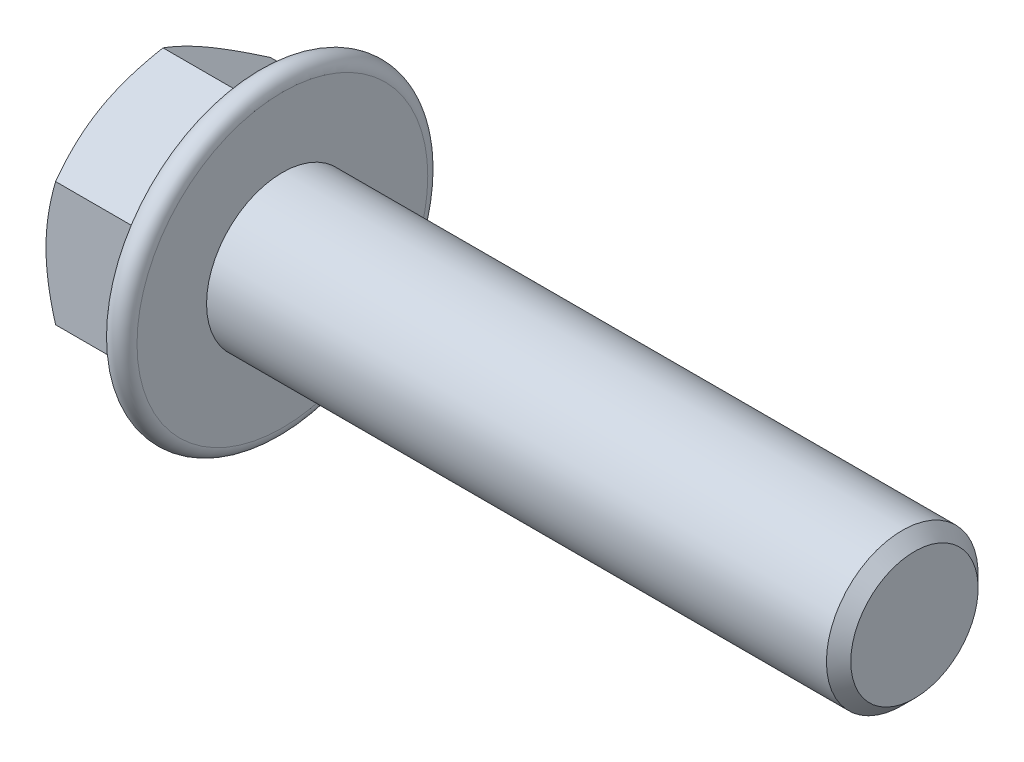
ISO-10303-21;
HEADER;
FILE_DESCRIPTION(('STEP AP214'),'2;1');
FILE_NAME('part.step','',(''),(''),'','','');
FILE_SCHEMA(('AUTOMOTIVE_DESIGN { 1 0 10303 214 1 1 1 1 }'));
ENDSEC;
DATA;
#1=APPLICATION_CONTEXT('core data for automotive mechanical design processes');
#2=APPLICATION_PROTOCOL_DEFINITION('international standard','automotive_design',2000,#1);
#3=PRODUCT_CONTEXT('',#1,'mechanical');
#4=PRODUCT('Part','Part','',(#3));
#5=PRODUCT_RELATED_PRODUCT_CATEGORY('part','',(#4));
#6=PRODUCT_DEFINITION_FORMATION('','',#4);
#7=PRODUCT_DEFINITION_CONTEXT('part definition',#1,'design');
#8=PRODUCT_DEFINITION('design','',#6,#7);
#9=PRODUCT_DEFINITION_SHAPE('','',#8);
#10=(LENGTH_UNIT() NAMED_UNIT(*) SI_UNIT(.MILLI.,.METRE.));
#11=(NAMED_UNIT(*) PLANE_ANGLE_UNIT() SI_UNIT($,.RADIAN.));
#12=(NAMED_UNIT(*) SI_UNIT($,.STERADIAN.) SOLID_ANGLE_UNIT());
#13=UNCERTAINTY_MEASURE_WITH_UNIT(LENGTH_MEASURE(1.E-05),#10,'distance_accuracy_value','');
#14=(GEOMETRIC_REPRESENTATION_CONTEXT(3) GLOBAL_UNCERTAINTY_ASSIGNED_CONTEXT((#13)) GLOBAL_UNIT_ASSIGNED_CONTEXT((#10,
#11,#12)) REPRESENTATION_CONTEXT('',''));
#15=CARTESIAN_POINT('',(0.,0.,0.));
#16=DIRECTION('',(0.,0.,1.));
#17=DIRECTION('',(1.,0.,0.));
#18=AXIS2_PLACEMENT_3D('',#15,#16,#17);
#19=CARTESIAN_POINT('',(10.2,9.81495457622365,0.));
#20=DIRECTION('',(1.,0.,0.));
#21=DIRECTION('',(0.,0.,-1.));
#22=AXIS2_PLACEMENT_3D('',#19,#20,#21);
#23=PLANE('',#22);
#24=CARTESIAN_POINT('',(10.2,0.,0.));
#25=DIRECTION('',(1.,0.,0.));
#26=DIRECTION('',(0.,0.,-1.));
#27=AXIS2_PLACEMENT_3D('',#24,#25,#26);
#28=CIRCLE('',#27,6.);
#29=CARTESIAN_POINT('',(10.2,0.,-6.));
#30=VERTEX_POINT('',#29);
#31=EDGE_CURVE('E452',#30,#30,#28,.F.);
#32=ORIENTED_EDGE('',*,*,#31,.T.);
#33=EDGE_LOOP('',(#32));
#34=FACE_BOUND('',#33,.T.);
#35=CARTESIAN_POINT('',(10.2,0.,0.));
#36=DIRECTION('',(-1.,0.,0.));
#37=DIRECTION('',(0.,0.,1.));
#38=AXIS2_PLACEMENT_3D('',#35,#36,#37);
#39=CIRCLE('',#38,11.5);
#40=CARTESIAN_POINT('',(10.2,0.,11.5));
#41=VERTEX_POINT('',#40);
#42=EDGE_CURVE('E422',#41,#41,#39,.T.);
#43=ORIENTED_EDGE('',*,*,#42,.F.);
#44=EDGE_LOOP('',(#43));
#45=FACE_BOUND('',#44,.T.);
#46=ADVANCED_FACE('F35',(#34,#45),#23,.T.);
#47=CARTESIAN_POINT('',(0.,0.,0.));
#48=DIRECTION('',(-1.,0.,0.));
#49=DIRECTION('',(0.,0.,1.));
#50=AXIS2_PLACEMENT_3D('',#47,#48,#49);
#51=CYLINDRICAL_SURFACE('',#50,6.);
#52=ORIENTED_EDGE('',*,*,#31,.F.);
#53=EDGE_LOOP('',(#52));
#54=FACE_BOUND('',#53,.T.);
#55=CARTESIAN_POINT('',(59.236,0.,0.));
#56=DIRECTION('',(-1.,0.,0.));
#57=DIRECTION('',(0.,0.,1.));
#58=AXIS2_PLACEMENT_3D('',#55,#56,#57);
#59=CIRCLE('',#58,6.);
#60=CARTESIAN_POINT('',(59.236,0.,6.));
#61=VERTEX_POINT('',#60);
#62=EDGE_CURVE('E455',#61,#61,#59,.T.);
#63=ORIENTED_EDGE('',*,*,#62,.T.);
#64=EDGE_LOOP('',(#63));
#65=FACE_BOUND('',#64,.T.);
#66=ADVANCED_FACE('F538',(#54,#65),#51,.T.);
#67=CARTESIAN_POINT('',(60.2,0.,0.));
#68=DIRECTION('',(-1.,0.,0.));
#69=DIRECTION('',(0.,0.,1.));
#70=AXIS2_PLACEMENT_3D('',#67,#68,#69);
#71=CONICAL_SURFACE('',#70,5.036,0.785398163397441);
#72=ORIENTED_EDGE('',*,*,#62,.F.);
#73=EDGE_LOOP('',(#72));
#74=FACE_BOUND('',#73,.T.);
#75=CARTESIAN_POINT('',(60.2,0.,0.));
#76=DIRECTION('',(-1.,0.,0.));
#77=DIRECTION('',(0.,0.,1.));
#78=AXIS2_PLACEMENT_3D('',#75,#76,#77);
#79=CIRCLE('',#78,5.036);
#80=CARTESIAN_POINT('',(60.2,0.,5.036));
#81=VERTEX_POINT('',#80);
#82=EDGE_CURVE('E530',#81,#81,#79,.T.);
#83=ORIENTED_EDGE('',*,*,#82,.T.);
#84=EDGE_LOOP('',(#83));
#85=FACE_BOUND('',#84,.T.);
#86=ADVANCED_FACE('F544',(#74,#85),#71,.T.);
#87=CARTESIAN_POINT('',(60.2,0.,0.));
#88=DIRECTION('',(-1.,0.,0.));
#89=DIRECTION('',(0.,0.,1.));
#90=AXIS2_PLACEMENT_3D('',#87,#88,#89);
#91=PLANE('',#90);
#92=ORIENTED_EDGE('',*,*,#82,.F.);
#93=EDGE_LOOP('',(#92));
#94=FACE_BOUND('',#93,.T.);
#95=ADVANCED_FACE('F207',(#94),#91,.F.);
#96=CARTESIAN_POINT('',(8.20000152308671,0.,0.));
#97=DIRECTION('',(1.,0.,0.));
#98=DIRECTION('',(0.,0.,-1.));
#99=AXIS2_PLACEMENT_3D('',#96,#97,#98);
#100=CONICAL_SURFACE('',#99,11.5017453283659,1.56905099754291);
#101=CARTESIAN_POINT('',(7.46538372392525,48.0723281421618,-8.5));
#102=CARTESIAN_POINT('',(8.26511739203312,48.070957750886,-8.5));
#103=CARTESIAN_POINT('',(8.26538250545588,48.0709572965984,-9.29973479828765));
#104=CARTESIAN_POINT('',(7.45853238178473,44.0663000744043,-8.5));
#105=CARTESIAN_POINT('',(8.25824225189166,44.0649157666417,-8.5));
#106=CARTESIAN_POINT('',(8.25853116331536,44.0649340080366,-9.29971101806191));
#107=CARTESIAN_POINT('',(7.45168341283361,40.0602720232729,-8.5));
#108=CARTESIAN_POINT('',(8.25136954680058,40.058991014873,-8.5));
#109=CARTESIAN_POINT('',(8.25168219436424,40.05891040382,-9.29968710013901));
#110=CARTESIAN_POINT('',(7.43814109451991,32.0482114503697,-8.5));
#111=CARTESIAN_POINT('',(8.2377556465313,32.0469690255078,-8.5));
#112=CARTESIAN_POINT('',(8.23813987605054,32.0468690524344,-9.2996154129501));
#113=CARTESIAN_POINT('',(7.43144774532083,28.0421789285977,-8.5));
#114=CARTESIAN_POINT('',(8.2310146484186,28.0409911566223,-8.5));
#115=CARTESIAN_POINT('',(8.23144652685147,28.0408513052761,-9.29956764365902));
#116=CARTESIAN_POINT('',(7.41836756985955,20.0301225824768,-8.5));
#117=CARTESIAN_POINT('',(8.21779177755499,20.0290653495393,-8.5));
#118=CARTESIAN_POINT('',(8.21836635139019,20.0288458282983,-9.29942467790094));
#119=CARTESIAN_POINT('',(7.41198074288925,16.0240987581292,-8.5));
#120=CARTESIAN_POINT('',(8.21131027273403,16.0233547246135,-8.5));
#121=CARTESIAN_POINT('',(8.21197952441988,16.0228580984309,-9.29932948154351));
#122=CARTESIAN_POINT('',(7.40368212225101,10.0150623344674,-8.5));
#123=CARTESIAN_POINT('',(8.20273563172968,10.0141248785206,-8.5));
#124=CARTESIAN_POINT('',(8.20368090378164,10.0140262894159,-9.29905349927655));
#125=CARTESIAN_POINT('',(7.40112951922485,8.01205065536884,-8.5));
#126=CARTESIAN_POINT('',(8.20006911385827,8.01127726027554,-8.5));
#127=CARTESIAN_POINT('',(8.20112830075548,8.01110789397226,-9.29893930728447));
#128=CARTESIAN_POINT('',(7.39737246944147,4.00602609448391,-8.5));
#129=CARTESIAN_POINT('',(8.19608864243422,4.00556634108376,-8.5));
#130=CARTESIAN_POINT('',(8.1973712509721,4.00545334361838,-9.29871518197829));
#131=CARTESIAN_POINT('',(7.39616802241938,2.00301321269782,-8.5));
#132=CARTESIAN_POINT('',(8.19477448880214,2.00269232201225,-8.5));
#133=CARTESIAN_POINT('',(8.19616680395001,2.00271718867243,-9.29860524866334));
#134=CARTESIAN_POINT('',(7.39615347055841,-0.775000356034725,-8.5));
#135=CARTESIAN_POINT('',(8.19475783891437,-0.774875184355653,-8.5));
#136=CARTESIAN_POINT('',(8.19615225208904,-0.77488581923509,-9.29860315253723));
#137=CARTESIAN_POINT('',(7.39632815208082,-1.55000103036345,-8.5));
#138=CARTESIAN_POINT('',(8.19494812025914,-1.54977969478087,-8.5));
#139=CARTESIAN_POINT('',(8.19632693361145,-1.54976906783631,-9.29861879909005));
#140=CARTESIAN_POINT('',(7.39698600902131,-3.10000231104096,-8.5));
#141=CARTESIAN_POINT('',(8.19565905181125,-3.09957325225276,-8.5));
#142=CARTESIAN_POINT('',(8.19698479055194,-3.09955698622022,-9.29867205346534));
#143=CARTESIAN_POINT('',(7.39746918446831,-3.87500291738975,-8.5));
#144=CARTESIAN_POINT('',(8.19617972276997,-3.87448353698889,-8.5));
#145=CARTESIAN_POINT('',(8.19746796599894,-3.87446165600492,-9.29870966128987));
#146=CARTESIAN_POINT('',(7.39867763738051,-5.42500420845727,-8.5));
#147=CARTESIAN_POINT('',(8.19747088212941,-5.42431679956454,-8.5));
#148=CARTESIAN_POINT('',(8.19867641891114,-5.42429661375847,-9.29879262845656));
#149=CARTESIAN_POINT('',(7.39940291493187,-6.20000489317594,-8.5));
#150=CARTESIAN_POINT('',(8.19824138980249,-6.19924727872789,-8.5));
#151=CARTESIAN_POINT('',(8.1994016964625,-6.19922690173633,-9.29883798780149));
#152=CARTESIAN_POINT('',(7.40102794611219,-7.75000600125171,-8.5));
#153=CARTESIAN_POINT('',(8.19995618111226,-7.74913396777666,-8.5));
#154=CARTESIAN_POINT('',(8.20102672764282,-7.74910847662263,-9.29892799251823));
#155=CARTESIAN_POINT('',(7.40192769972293,-8.52500642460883,-8.5));
#156=CARTESIAN_POINT('',(8.20090047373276,-8.52408949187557,-8.5));
#157=CARTESIAN_POINT('',(8.20192648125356,-8.52405976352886,-9.29897263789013));
#158=CARTESIAN_POINT('',(7.40288087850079,-9.30000676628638,-8.5));
#159=CARTESIAN_POINT('',(8.2018935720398,-9.29902067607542,-8.5));
#160=CARTESIAN_POINT('',(8.20287966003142,-9.29901945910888,-9.29901269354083));
#161=(BOUNDED_SURFACE() B_SPLINE_SURFACE(3,2,((#101,#102,#103),(#104,#105,#106),(#107,#108,
#109),(#110,#111,#112),(#113,#114,#115),(#116,#117,#118),(#119,#120,#121),(#122,#123,#124),
(#125,#126,#127),(#128,#129,#130),(#131,#132,#133),(#134,#135,#136),(#137,#138,#139),(#140,#141,
#142),(#143,#144,#145),(#146,#147,#148),(#149,#150,#151),(#152,#153,#154),(#155,#156,#157),
(#158,#159,#160)),.UNSPECIFIED.,.F.,.F.,.F.) B_SPLINE_SURFACE_WITH_KNOTS((4,2,2,2,2,2,2,2,2,4),
(3,3),(0.,12.0181017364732,24.0362160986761,36.0543026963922,42.0633425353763,48.0723811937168,
50.3973831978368,52.7223854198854,55.0473884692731,57.3723912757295),(0.,1.),
.UNSPECIFIED.) GEOMETRIC_REPRESENTATION_ITEM() RATIONAL_B_SPLINE_SURFACE(((1.,0.707223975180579,
1.),(1.,0.70723448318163,1.),(1.,0.707245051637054,1.),(1.,0.707276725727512,1.),(1.,
0.707297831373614,1.),(1.,0.707360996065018,1.),(1.,0.707403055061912,1.),(1.,0.707524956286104,
1.),(1.,0.70757539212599,1.),(1.,0.7076743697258,1.),(1.,0.707722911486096,1.),(1.,
0.70772383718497,1.),(1.,0.707716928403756,1.),(1.,0.707693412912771,1.),(1.,0.70767680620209,
1.),(1.,0.707640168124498,1.),(1.,0.707620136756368,1.),(1.,0.707580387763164,1.),(1.,
0.707560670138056,1.),(1.,0.707542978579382,1.))) REPRESENTATION_ITEM('') SURFACE());
#162=CARTESIAN_POINT('',(8.20287966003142,-9.29901945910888,-9.29901269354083));
#163=CARTESIAN_POINT('',(8.20192648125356,-8.52405976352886,-9.29897263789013));
#164=CARTESIAN_POINT('',(8.20102672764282,-7.74910847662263,-9.29892799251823));
#165=CARTESIAN_POINT('',(8.1994016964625,-6.19922690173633,-9.29883798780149));
#166=CARTESIAN_POINT('',(8.19867641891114,-5.42429661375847,-9.29879262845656));
#167=CARTESIAN_POINT('',(8.19746796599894,-3.87446165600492,-9.29870966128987));
#168=CARTESIAN_POINT('',(8.19698479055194,-3.09955698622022,-9.29867205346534));
#169=CARTESIAN_POINT('',(8.19632693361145,-1.54976906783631,-9.29861879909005));
#170=CARTESIAN_POINT('',(8.19615225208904,-0.774885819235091,-9.29860315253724));
#171=CARTESIAN_POINT('',(8.19616680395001,2.00271718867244,-9.29860524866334));
#172=CARTESIAN_POINT('',(8.1973712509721,4.00545334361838,-9.29871518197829));
#173=CARTESIAN_POINT('',(8.20112830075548,8.01110789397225,-9.29893930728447));
#174=CARTESIAN_POINT('',(8.20368090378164,10.0140262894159,-9.29905349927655));
#175=CARTESIAN_POINT('',(8.21197952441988,16.0228580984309,-9.29932948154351));
#176=CARTESIAN_POINT('',(8.21836635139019,20.0288458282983,-9.29942467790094));
#177=CARTESIAN_POINT('',(8.23144652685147,28.0408513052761,-9.29956764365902));
#178=CARTESIAN_POINT('',(8.23813987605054,32.0468690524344,-9.2996154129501));
#179=CARTESIAN_POINT('',(8.25168219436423,40.05891040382,-9.29968710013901));
#180=CARTESIAN_POINT('',(8.25853116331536,44.0649340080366,-9.29971101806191));
#181=CARTESIAN_POINT('',(8.26538250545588,48.0709572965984,-9.29973479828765));
#182=B_SPLINE_CURVE_WITH_KNOTS('',3,(#162,#163,#164,#165,#166,#167,#168,#169,#170,#171,#172,
#173,#174,#175,#176,#177,#178,#179,#180,#181),.UNSPECIFIED.,.F.,.F.,(4,2,2,2,2,2,2,2,2,4),(0.,
2.32500280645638,4.65000585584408,6.97500807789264,9.30001008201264,15.3090487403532,
21.3180885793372,33.3361751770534,45.3542895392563,57.3723912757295),.UNSPECIFIED.);
#183=CARTESIAN_POINT('',(8.19866734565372,-5.36865937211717,-9.29879080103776));
#184=VERTEX_POINT('',#183);
#185=CARTESIAN_POINT('',(8.19866734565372,5.36865937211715,-9.29879080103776));
#186=VERTEX_POINT('',#185);
#187=EDGE_CURVE('E499',#184,#186,#182,.T.);
#188=ORIENTED_EDGE('',*,*,#187,.T.);
#189=CARTESIAN_POINT('',(7.46538455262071,31.3976218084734,37.3822762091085));
#190=CARTESIAN_POINT('',(8.26511822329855,31.3969366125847,37.381089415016));
#191=CARTESIAN_POINT('',(8.26538333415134,32.0895270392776,36.9812216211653));
#192=CARTESIAN_POINT('',(7.45853313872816,29.3945876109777,33.9129192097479));
#193=CARTESIAN_POINT('',(8.25824301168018,29.3938954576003,33.9117203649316));
#194=CARTESIAN_POINT('',(8.25853192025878,30.0864746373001,33.5118806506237));
#195=CARTESIAN_POINT('',(7.45168409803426,27.3915534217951,30.4435622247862));
#196=CARTESIAN_POINT('',(8.25137023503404,27.390912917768,30.4424528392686));
#197=CARTESIAN_POINT('',(8.25168287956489,28.0834219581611,30.042539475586));
#198=CARTESIAN_POINT('',(7.43814163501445,23.3854828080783,23.5048443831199));
#199=CARTESIAN_POINT('',(8.23775619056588,23.3848615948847,23.5037684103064));
#200=CARTESIAN_POINT('',(8.23814041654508,24.0772988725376,23.103874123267));
#201=CARTESIAN_POINT('',(7.43144821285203,21.3824463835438,20.0354835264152));
#202=CARTESIAN_POINT('',(8.23101511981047,21.381852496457,20.0344548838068));
#203=CARTESIAN_POINT('',(8.23144699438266,22.0742284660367,19.6345499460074));
#204=CARTESIAN_POINT('',(7.41836788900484,17.3763778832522,13.0967693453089));
#205=CARTESIAN_POINT('',(8.21779210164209,17.3758492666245,13.095853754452));
#206=CARTESIAN_POINT('',(8.21836667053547,18.0680615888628,12.6959513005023));
#207=CARTESIAN_POINT('',(7.41198098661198,15.3733458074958,9.62741602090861));
#208=CARTESIAN_POINT('',(8.21131052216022,15.3729737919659,9.62677167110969));
#209=CARTESIAN_POINT('',(8.21197976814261,16.0649651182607,9.22667683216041));
#210=CARTESIAN_POINT('',(7.40368225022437,12.3687973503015,4.42338543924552));
#211=CARTESIAN_POINT('',(8.20273576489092,12.36832862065,4.42257357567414));
#212=CARTESIAN_POINT('',(8.20368103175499,13.0602799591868,4.02296144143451));
#213=CARTESIAN_POINT('',(7.40112960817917,11.3672814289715,2.68870897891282));
#214=CARTESIAN_POINT('',(8.20006920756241,11.3668947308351,2.68803919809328));
#215=CARTESIAN_POINT('',(8.2011283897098,12.0587117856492,2.28842286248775));
#216=CARTESIAN_POINT('',(7.39737249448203,9.36424898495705,-0.780644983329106));
#217=CARTESIAN_POINT('',(8.19608866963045,9.3640191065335,-0.781043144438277));
#218=CARTESIAN_POINT('',(8.19737127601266,10.0556702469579,-1.18049859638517));
#219=CARTESIAN_POINT('',(7.39616802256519,8.36273246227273,-2.51532248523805));
#220=CARTESIAN_POINT('',(8.19477448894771,8.36257201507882,-2.51560038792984));
#221=CARTESIAN_POINT('',(8.19616680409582,9.05419688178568,-2.91488147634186));
#222=CARTESIAN_POINT('',(7.39615347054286,6.9737155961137,-4.92117026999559));
#223=CARTESIAN_POINT('',(8.19475783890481,6.97377818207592,-4.92106186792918));
#224=CARTESIAN_POINT('',(8.19615225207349,7.66538348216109,-5.32037265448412));
#225=CARTESIAN_POINT('',(7.3963281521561,6.58621525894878,-5.59234054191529));
#226=CARTESIAN_POINT('',(8.1949481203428,6.58632592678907,-5.59214885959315));
#227=CARTESIAN_POINT('',(8.19632693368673,7.27795540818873,-5.99144905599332));
#228=CARTESIAN_POINT('',(7.39698600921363,5.81121461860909,-6.93468102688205));
#229=CARTESIAN_POINT('',(8.19565905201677,5.81142914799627,-6.93430945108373));
#230=CARTESIAN_POINT('',(8.19698479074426,6.50310756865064,-7.33363139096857));
#231=CARTESIAN_POINT('',(7.39746918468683,5.42371431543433,-7.60585123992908));
#232=CARTESIAN_POINT('',(8.19617972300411,5.42397400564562,-7.60540144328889));
#233=CARTESIAN_POINT('',(8.19746796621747,6.11568780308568,-8.00473732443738));
#234=CARTESIAN_POINT('',(7.3986776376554,4.64871366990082,-8.94819173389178));
#235=CARTESIAN_POINT('',(8.19747088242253,4.6490573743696,-8.94759642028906));
#236=CARTESIAN_POINT('',(8.19867641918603,5.34084217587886,-9.34697525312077));
#237=CARTESIAN_POINT('',(7.39940291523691,4.26121332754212,-9.61936201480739));
#238=CARTESIAN_POINT('',(8.19824139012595,4.26159213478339,-9.61870590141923));
#239=CARTESIAN_POINT('',(8.19940169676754,4.95341631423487,-10.0181072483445));
#240=CARTESIAN_POINT('',(7.40102794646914,3.48621277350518,-10.9617023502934));
#241=CARTESIAN_POINT('',(8.19995618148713,3.48664879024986,-10.9609471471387));
#242=CARTESIAN_POINT('',(8.20102672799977,4.17855347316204,-11.3603890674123));
#243=CARTESIAN_POINT('',(7.40192770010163,3.09871256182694,-11.6328724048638));
#244=CARTESIAN_POINT('',(8.20090047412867,3.09917102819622,-11.6320783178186));
#245=CARTESIAN_POINT('',(8.20192648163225,3.79111649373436,-12.0315388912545));
#246=CARTESIAN_POINT('',(7.40288087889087,2.71121239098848,-12.3040423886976));
#247=CARTESIAN_POINT('',(8.20189357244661,2.71170543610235,-12.30318840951));
#248=CARTESIAN_POINT('',(8.20287966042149,3.40367133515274,-12.7026937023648));
#249=(BOUNDED_SURFACE() B_SPLINE_SURFACE(3,2,((#189,#190,#191),(#192,#193,#194),(#195,#196,
#197),(#198,#199,#200),(#201,#202,#203),(#204,#205,#206),(#207,#208,#209),(#210,#211,#212),
(#213,#214,#215),(#216,#217,#218),(#219,#220,#221),(#222,#223,#224),(#225,#226,#227),(#228,#229,
#230),(#231,#232,#233),(#234,#235,#236),(#237,#238,#239),(#240,#241,#242),(#243,#244,#245),
(#246,#247,#248)),.UNSPECIFIED.,.F.,.F.,.F.) B_SPLINE_SURFACE_WITH_KNOTS((4,2,2,2,2,2,2,2,2,4),
(3,3),(0.,12.0182227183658,24.0364580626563,36.0546656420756,42.063765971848,48.0728651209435,
50.3978671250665,52.7228693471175,55.0478723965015,57.372875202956),(0.,1.),
.UNSPECIFIED.) GEOMETRIC_REPRESENTATION_ITEM() RATIONAL_B_SPLINE_SURFACE(((1.,0.707223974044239,
1.),(1.,0.707234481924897,1.),(1.,0.707245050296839,1.),(1.,0.707276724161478,1.),(1.,
0.707297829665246,1.),(1.,0.707360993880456,1.),(1.,0.707403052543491,1.),(1.,0.707524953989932,
1.),(1.,0.707575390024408,1.),(1.,0.707674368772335,1.),(1.,0.707722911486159,1.),(1.,
0.707723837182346,1.),(1.,0.707716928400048,1.),(1.,0.707693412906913,1.),(1.,0.707676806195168,
1.),(1.,0.707640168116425,1.),(1.,0.707620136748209,1.),(1.,0.707580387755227,1.),(1.,
0.707560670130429,1.),(1.,0.707542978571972,1.))) REPRESENTATION_ITEM('') SURFACE());
#250=CARTESIAN_POINT('',(8.20287966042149,3.40367133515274,-12.7026937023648));
#251=CARTESIAN_POINT('',(8.20192648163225,3.79111649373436,-12.0315388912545));
#252=CARTESIAN_POINT('',(8.20102672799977,4.17855347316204,-11.3603890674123));
#253=CARTESIAN_POINT('',(8.19940169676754,4.95341631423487,-10.0181072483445));
#254=CARTESIAN_POINT('',(8.19867641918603,5.34084217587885,-9.34697525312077));
#255=CARTESIAN_POINT('',(8.19746796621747,6.11568780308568,-8.00473732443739));
#256=CARTESIAN_POINT('',(8.19698479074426,6.50310756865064,-7.33363139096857));
#257=CARTESIAN_POINT('',(8.19632693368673,7.27795540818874,-5.99144905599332));
#258=CARTESIAN_POINT('',(8.19615225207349,7.66538348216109,-5.32037265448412));
#259=CARTESIAN_POINT('',(8.19616680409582,9.05419688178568,-2.91488147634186));
#260=CARTESIAN_POINT('',(8.19737127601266,10.0556702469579,-1.18049859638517));
#261=CARTESIAN_POINT('',(8.2011283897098,12.0587117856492,2.28842286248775));
#262=CARTESIAN_POINT('',(8.20368103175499,13.0602799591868,4.02296144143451));
#263=CARTESIAN_POINT('',(8.21197976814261,16.0649651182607,9.22667683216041));
#264=CARTESIAN_POINT('',(8.21836667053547,18.0680615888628,12.6959513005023));
#265=CARTESIAN_POINT('',(8.23144699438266,22.0742284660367,19.6345499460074));
#266=CARTESIAN_POINT('',(8.23814041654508,24.0772988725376,23.103874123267));
#267=CARTESIAN_POINT('',(8.25168287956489,28.0834219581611,30.042539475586));
#268=CARTESIAN_POINT('',(8.25853192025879,30.0864746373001,33.5118806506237));
#269=CARTESIAN_POINT('',(8.26538333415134,32.0895270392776,36.9812216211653));
#270=B_SPLINE_CURVE_WITH_KNOTS('',3,(#250,#251,#252,#253,#254,#255,#256,#257,#258,#259,#260,
#261,#262,#263,#264,#265,#266,#267,#268,#269),.UNSPECIFIED.,.F.,.F.,(4,2,2,2,2,2,2,2,2,4),(0.,
2.32500280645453,4.65000585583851,6.97500807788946,9.30001008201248,15.309109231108,
21.3182095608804,33.3364171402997,45.3546524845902,57.372875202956),.UNSPECIFIED.);
#271=CARTESIAN_POINT('',(8.19866734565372,10.7373187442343,0.));
#272=VERTEX_POINT('',#271);
#273=EDGE_CURVE('E505',#186,#272,#270,.T.);
#274=ORIENTED_EDGE('',*,*,#273,.T.);
#275=CARTESIAN_POINT('',(7.46538455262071,-16.675189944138,45.8822762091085));
#276=CARTESIAN_POINT('',(8.26511822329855,-16.6745047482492,45.881089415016));
#277=CARTESIAN_POINT('',(8.26538333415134,-15.9819138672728,46.2809564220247));
#278=CARTESIAN_POINT('',(7.45853313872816,-14.6721557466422,42.4129192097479));
#279=CARTESIAN_POINT('',(8.25824301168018,-14.6714635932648,42.4117203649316));
#280=CARTESIAN_POINT('',(8.25853192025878,-13.9789026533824,42.8115916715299));
#281=CARTESIAN_POINT('',(7.45168409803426,-12.6691215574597,38.9435622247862));
#282=CARTESIAN_POINT('',(8.25137023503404,-12.6684810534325,38.9424528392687));
#283=CARTESIAN_POINT('',(8.25168287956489,-11.9758914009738,39.3422265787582));
#284=CARTESIAN_POINT('',(7.43814163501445,-8.66305094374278,32.0048443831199));
#285=CARTESIAN_POINT('',(8.23775619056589,-8.66242973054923,32.0037684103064));
#286=CARTESIAN_POINT('',(8.23814041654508,-7.96989248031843,32.4034895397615));
#287=CARTESIAN_POINT('',(7.43144821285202,-6.66001451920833,28.5354835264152));
#288=CARTESIAN_POINT('',(8.23101511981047,-6.65942063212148,28.5344548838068));
#289=CARTESIAN_POINT('',(8.23144699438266,-5.96690481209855,28.9341175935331));
#290=CARTESIAN_POINT('',(7.41836788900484,-2.65394601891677,21.596769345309));
#291=CARTESIAN_POINT('',(8.2177921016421,-2.65341740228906,21.595853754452));
#292=CARTESIAN_POINT('',(8.21836667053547,-1.96098555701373,21.9953759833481));
#293=CARTESIAN_POINT('',(7.41198098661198,-0.650913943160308,18.1274160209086));
#294=CARTESIAN_POINT('',(8.21131052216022,-0.650541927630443,18.1267716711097));
#295=CARTESIAN_POINT('',(8.21197976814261,0.0419460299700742,18.5260063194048));
#296=CARTESIAN_POINT('',(7.40368225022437,2.35363451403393,12.9233854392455));
#297=CARTESIAN_POINT('',(8.20273576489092,2.35410324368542,12.9225735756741));
#298=CARTESIAN_POINT('',(8.20368103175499,3.04615317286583,13.3220149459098));
#299=CARTESIAN_POINT('',(7.40112960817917,3.35515043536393,11.1887089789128));
#300=CARTESIAN_POINT('',(8.20006920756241,3.35553713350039,11.1880391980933));
#301=CARTESIAN_POINT('',(8.2011283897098,4.04752355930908,11.5873621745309));
#302=CARTESIAN_POINT('',(7.39737249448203,5.3581828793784,7.71935501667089));
#303=CARTESIAN_POINT('',(8.19608866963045,5.35841275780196,7.71895685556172));
#304=CARTESIAN_POINT('',(8.19737127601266,6.05017689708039,8.11821658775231));
#305=CARTESIAN_POINT('',(7.39616802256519,6.35969940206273,5.98467751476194));
#306=CARTESIAN_POINT('',(8.19477448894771,6.35985984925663,5.98439961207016));
#307=CARTESIAN_POINT('',(8.19616680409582,7.05145984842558,6.38372377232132));
#308=CARTESIAN_POINT('',(7.39615347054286,7.74871626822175,3.57882973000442));
#309=CARTESIAN_POINT('',(8.19475783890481,7.74865368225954,3.57893813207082));
#310=CARTESIAN_POINT('',(8.19615225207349,8.44026961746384,3.97823049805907));
#311=CARTESIAN_POINT('',(7.3963281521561,8.13621660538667,2.90765945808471));
#312=CARTESIAN_POINT('',(8.1949481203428,8.13610593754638,2.90785114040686));
#313=CARTESIAN_POINT('',(8.19632693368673,8.82772479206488,3.30716974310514));
#314=CARTESIAN_POINT('',(7.39698600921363,8.91121724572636,1.56531897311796));
#315=CARTESIAN_POINT('',(8.19565905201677,8.91100271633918,1.56569054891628));
#316=CARTESIAN_POINT('',(8.19698479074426,9.60266487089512,1.96504066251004));
#317=CARTESIAN_POINT('',(7.39746918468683,9.29871754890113,0.894148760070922));
#318=CARTESIAN_POINT('',(8.19617972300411,9.29845785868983,0.894598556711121));
#319=CARTESIAN_POINT('',(8.19746796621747,9.9901497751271,1.29397233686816));
#320=CARTESIAN_POINT('',(7.3986776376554,10.0737181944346,-0.448191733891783));
#321=CARTESIAN_POINT('',(8.19747088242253,10.0733744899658,-0.447596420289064));
#322=CARTESIAN_POINT('',(8.19867641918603,10.7651391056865,-0.0481826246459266));
#323=CARTESIAN_POINT('',(7.39940291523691,10.4612185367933,-1.11936201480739));
#324=CARTESIAN_POINT('',(8.19824139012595,10.4608397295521,-1.11870590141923));
#325=CARTESIAN_POINT('',(8.19940169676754,11.1526435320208,-0.719269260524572));
#326=CARTESIAN_POINT('',(7.40102794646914,11.2362190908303,-2.46170235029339));
#327=CARTESIAN_POINT('',(8.19995618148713,11.2357830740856,-2.46094714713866));
#328=CARTESIAN_POINT('',(8.20102672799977,11.9276622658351,-2.06146107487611));
#329=CARTESIAN_POINT('',(7.40192770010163,11.6237193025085,-3.1328724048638));
#330=CARTESIAN_POINT('',(8.20090047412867,11.6232608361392,-3.13207831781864));
#331=CARTESIAN_POINT('',(8.20192648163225,12.315176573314,-2.73256625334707));
#332=CARTESIAN_POINT('',(7.40288087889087,12.011219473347,-3.80404238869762));
#333=CARTESIAN_POINT('',(8.20189357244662,12.0107264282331,-3.80318840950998));
#334=CARTESIAN_POINT('',(8.20287966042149,12.7026911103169,-3.40368100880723));
#335=(BOUNDED_SURFACE() B_SPLINE_SURFACE(3,2,((#275,#276,#277),(#278,#279,#280),(#281,#282,
#283),(#284,#285,#286),(#287,#288,#289),(#290,#291,#292),(#293,#294,#295),(#296,#297,#298),
(#299,#300,#301),(#302,#303,#304),(#305,#306,#307),(#308,#309,#310),(#311,#312,#313),(#314,#315,
#316),(#317,#318,#319),(#320,#321,#322),(#323,#324,#325),(#326,#327,#328),(#329,#330,#331),
(#332,#333,#334)),.UNSPECIFIED.,.F.,.F.,.F.) B_SPLINE_SURFACE_WITH_KNOTS((4,2,2,2,2,2,2,2,2,4),
(3,3),(0.,12.0182227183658,24.0364580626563,36.0546656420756,42.063765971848,48.0728651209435,
50.3978671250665,52.7228693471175,55.0478723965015,57.372875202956),(0.,1.),
.UNSPECIFIED.) GEOMETRIC_REPRESENTATION_ITEM() RATIONAL_B_SPLINE_SURFACE(((1.,0.707223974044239,
1.),(1.,0.707234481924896,1.),(1.,0.707245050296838,1.),(1.,0.707276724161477,1.),(1.,
0.707297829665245,1.),(1.,0.707360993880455,1.),(1.,0.707403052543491,1.),(1.,0.707524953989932,
1.),(1.,0.707575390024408,1.),(1.,0.707674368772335,1.),(1.,0.707722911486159,1.),(1.,
0.707723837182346,1.),(1.,0.707716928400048,1.),(1.,0.707693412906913,1.),(1.,0.707676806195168,
1.),(1.,0.707640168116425,1.),(1.,0.707620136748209,1.),(1.,0.707580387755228,1.),(1.,
0.707560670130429,1.),(1.,0.707542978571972,1.))) REPRESENTATION_ITEM('') SURFACE());
#336=CARTESIAN_POINT('',(8.20287966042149,12.7026911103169,-3.40368100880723));
#337=CARTESIAN_POINT('',(8.20192648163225,12.315176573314,-2.73256625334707));
#338=CARTESIAN_POINT('',(8.20102672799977,11.9276622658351,-2.06146107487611));
#339=CARTESIAN_POINT('',(8.19940169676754,11.1526435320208,-0.719269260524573));
#340=CARTESIAN_POINT('',(8.19867641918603,10.7651391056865,-0.0481826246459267));
#341=CARTESIAN_POINT('',(8.19746796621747,9.9901497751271,1.29397233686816));
#342=CARTESIAN_POINT('',(8.19698479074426,9.60266487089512,1.96504066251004));
#343=CARTESIAN_POINT('',(8.19632693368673,8.82772479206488,3.30716974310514));
#344=CARTESIAN_POINT('',(8.19615225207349,8.44026961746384,3.97823049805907));
#345=CARTESIAN_POINT('',(8.19616680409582,7.05145984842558,6.38372377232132));
#346=CARTESIAN_POINT('',(8.19737127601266,6.05017689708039,8.11821658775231));
#347=CARTESIAN_POINT('',(8.2011283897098,4.04752355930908,11.5873621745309));
#348=CARTESIAN_POINT('',(8.20368103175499,3.04615317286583,13.3220149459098));
#349=CARTESIAN_POINT('',(8.21197976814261,0.0419460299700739,18.5260063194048));
#350=CARTESIAN_POINT('',(8.21836667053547,-1.96098555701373,21.9953759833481));
#351=CARTESIAN_POINT('',(8.23144699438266,-5.96690481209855,28.9341175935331));
#352=CARTESIAN_POINT('',(8.23814041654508,-7.96989248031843,32.4034895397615));
#353=CARTESIAN_POINT('',(8.25168287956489,-11.9758914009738,39.3422265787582));
#354=CARTESIAN_POINT('',(8.25853192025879,-13.9789026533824,42.8115916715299));
#355=CARTESIAN_POINT('',(8.26538333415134,-15.9819138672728,46.2809564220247));
#356=B_SPLINE_CURVE_WITH_KNOTS('',3,(#336,#337,#338,#339,#340,#341,#342,#343,#344,#345,#346,
#347,#348,#349,#350,#351,#352,#353,#354,#355),.UNSPECIFIED.,.F.,.F.,(4,2,2,2,2,2,2,2,2,4),(0.,
2.32500280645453,4.65000585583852,6.97500807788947,9.30001008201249,15.309109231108,
21.3182095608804,33.3364171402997,45.3546524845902,57.372875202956),.UNSPECIFIED.);
#357=CARTESIAN_POINT('',(8.19866734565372,5.36865937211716,9.29879080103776));
#358=VERTEX_POINT('',#357);
#359=EDGE_CURVE('E467',#272,#358,#356,.T.);
#360=ORIENTED_EDGE('',*,*,#359,.T.);
#361=CARTESIAN_POINT('',(7.46538372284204,-48.0723275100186,8.5));
#362=CARTESIAN_POINT('',(8.26511739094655,-48.0709571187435,8.5));
#363=CARTESIAN_POINT('',(8.26538250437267,-48.0709566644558,9.29973479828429));
#364=CARTESIAN_POINT('',(7.45853238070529,-44.066299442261,8.5));
#365=CARTESIAN_POINT('',(8.25824225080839,-44.0649151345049,8.5));
#366=CARTESIAN_POINT('',(8.25853116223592,-44.0649333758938,9.29971101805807));
#367=CARTESIAN_POINT('',(7.45168341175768,-40.0602713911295,8.5));
#368=CARTESIAN_POINT('',(8.25136954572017,-40.0589903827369,8.5));
#369=CARTESIAN_POINT('',(8.25168219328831,-40.0589097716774,9.29968710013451));
#370=CARTESIAN_POINT('',(7.43814109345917,-32.0482108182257,8.5));
#371=CARTESIAN_POINT('',(8.23775564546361,-32.0469683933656,8.5));
#372=CARTESIAN_POINT('',(8.23813987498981,-32.0468684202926,9.29961541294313));
#373=CARTESIAN_POINT('',(7.43144774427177,-28.0421782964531,8.5));
#374=CARTESIAN_POINT('',(8.23101464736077,-28.0409905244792,8.5));
#375=CARTESIAN_POINT('',(8.23144652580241,-28.0408506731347,9.29956764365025));
#376=CARTESIAN_POINT('',(7.41836756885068,-20.0301219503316,8.5));
#377=CARTESIAN_POINT('',(8.21779177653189,-20.0290647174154,8.5));
#378=CARTESIAN_POINT('',(8.21836635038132,-20.0288451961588,9.29942467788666));
#379=CARTESIAN_POINT('',(7.4119807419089,-16.0240981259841,8.5));
#380=CARTESIAN_POINT('',(8.21131027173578,-16.0233540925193,8.5));
#381=CARTESIAN_POINT('',(8.21197952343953,-16.0228574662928,9.29932948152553));
#382=CARTESIAN_POINT('',(7.40368212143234,-10.0150617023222,8.5));
#383=CARTESIAN_POINT('',(8.20273563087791,-10.0141242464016,8.5));
#384=CARTESIAN_POINT('',(8.20368090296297,-10.0140256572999,9.29905349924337));
#385=CARTESIAN_POINT('',(7.40112951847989,-8.01205002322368,8.5));
#386=CARTESIAN_POINT('',(8.20006911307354,-8.01127662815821,8.5));
#387=CARTESIAN_POINT('',(8.20112830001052,-8.01110726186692,9.29893930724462));
#388=CARTESIAN_POINT('',(7.3973724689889,-4.00602546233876,8.5));
#389=CARTESIAN_POINT('',(8.19608864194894,-4.00556570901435,8.5));
#390=CARTESIAN_POINT('',(8.19737125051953,-4.00545271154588,9.29871518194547));
#391=CARTESIAN_POINT('',(7.39616802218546,-2.00301258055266,8.5));
#392=CARTESIAN_POINT('',(8.1947744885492,-2.00269168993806,8.5));
#393=CARTESIAN_POINT('',(8.19616680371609,-2.00271655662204,9.29860524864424));
#394=CARTESIAN_POINT('',(7.39615347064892,0.775000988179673,8.5));
#395=CARTESIAN_POINT('',(8.19475783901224,0.774875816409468,8.5));
#396=CARTESIAN_POINT('',(8.19615225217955,0.774886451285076,9.29860315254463));
#397=CARTESIAN_POINT('',(7.39632815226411,1.55000166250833,8.5));
#398=CARTESIAN_POINT('',(8.19494812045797,1.54978032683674,8.5));
#399=CARTESIAN_POINT('',(8.19632693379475,1.54976969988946,9.29861879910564));
#400=CARTESIAN_POINT('',(7.3969860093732,3.1000029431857,8.5));
#401=CARTESIAN_POINT('',(8.19565905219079,3.09957388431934,8.5));
#402=CARTESIAN_POINT('',(8.19698479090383,3.09955761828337,9.29867205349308));
#403=CARTESIAN_POINT('',(7.397469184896,3.87500354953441,8.5));
#404=CARTESIAN_POINT('',(8.19617972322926,3.87448416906,8.5));
#405=CARTESIAN_POINT('',(8.19746796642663,3.8744622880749,9.29870966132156));
#406=CARTESIAN_POINT('',(7.39867763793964,5.42500484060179,8.5));
#407=CARTESIAN_POINT('',(8.19747088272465,5.42431743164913,8.5));
#408=CARTESIAN_POINT('',(8.19867641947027,5.42429724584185,9.29879262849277));
#409=CARTESIAN_POINT('',(7.39940291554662,6.20000552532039,8.5));
#410=CARTESIAN_POINT('',(8.19824139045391,6.19924791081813,8.5));
#411=CARTESIAN_POINT('',(8.19940169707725,6.19922753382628,9.29883798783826));
#412=CARTESIAN_POINT('',(7.4010279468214,7.75000663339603,8.5));
#413=CARTESIAN_POINT('',(8.19995618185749,7.74913459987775,8.5));
#414=CARTESIAN_POINT('',(8.20102672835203,7.74910910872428,9.29892799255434));
#415=CARTESIAN_POINT('',(7.40192770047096,8.52500705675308,8.5));
#416=CARTESIAN_POINT('',(8.20090047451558,8.52409012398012,8.5));
#417=CARTESIAN_POINT('',(8.20192648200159,8.52406039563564,9.29897263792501));
#418=CARTESIAN_POINT('',(7.40288087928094,9.30000739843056,8.5));
#419=CARTESIAN_POINT('',(8.20189357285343,9.29902130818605,8.5));
#420=CARTESIAN_POINT('',(8.20287966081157,9.29902009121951,9.29901269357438));
#421=(BOUNDED_SURFACE() B_SPLINE_SURFACE(3,2,((#361,#362,#363),(#364,#365,#366),(#367,#368,
#369),(#370,#371,#372),(#373,#374,#375),(#376,#377,#378),(#379,#380,#381),(#382,#383,#384),
(#385,#386,#387),(#388,#389,#390),(#391,#392,#393),(#394,#395,#396),(#397,#398,#399),(#400,#401,
#402),(#403,#404,#405),(#406,#407,#408),(#409,#410,#411),(#412,#413,#414),(#415,#416,#417),
(#418,#419,#420)),.UNSPECIFIED.,.F.,.F.,.F.) B_SPLINE_SURFACE_WITH_KNOTS((4,2,2,2,2,2,2,2,2,4),
(3,3),(0.,12.0181017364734,24.0362160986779,36.054302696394,42.0633425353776,48.0723811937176,
50.3973831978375,52.722385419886,55.0473884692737,57.37239127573),(0.,1.),
.UNSPECIFIED.) GEOMETRIC_REPRESENTATION_ITEM() RATIONAL_B_SPLINE_SURFACE(((1.,0.707223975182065,
1.),(1.,0.707234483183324,1.),(1.,0.707245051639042,1.),(1.,0.70727672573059,1.),(1.,
0.70729783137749,1.),(1.,0.707360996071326,1.),(1.,0.707403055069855,1.),(1.,0.707524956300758,
1.),(1.,0.707575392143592,1.),(1.,0.707674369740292,1.),(1.,0.70772291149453,1.),(1.,
0.707723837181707,1.),(1.,0.707716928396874,1.),(1.,0.707693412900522,1.),(1.,0.707676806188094,
1.),(1.,0.707640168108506,1.),(1.,0.707620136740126,1.),(1.,0.707580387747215,1.),(1.,
0.70756067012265,1.),(1.,0.707542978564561,1.))) REPRESENTATION_ITEM('') SURFACE());
#422=CARTESIAN_POINT('',(8.20287966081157,9.29902009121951,9.29901269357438));
#423=CARTESIAN_POINT('',(8.20192648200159,8.52406039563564,9.29897263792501));
#424=CARTESIAN_POINT('',(8.20102672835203,7.74910910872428,9.29892799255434));
#425=CARTESIAN_POINT('',(8.19940169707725,6.19922753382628,9.29883798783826));
#426=CARTESIAN_POINT('',(8.19867641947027,5.42429724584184,9.29879262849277));
#427=CARTESIAN_POINT('',(8.19746796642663,3.8744622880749,9.29870966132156));
#428=CARTESIAN_POINT('',(8.19698479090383,3.09955761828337,9.29867205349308));
#429=CARTESIAN_POINT('',(8.19632693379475,1.54976969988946,9.29861879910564));
#430=CARTESIAN_POINT('',(8.19615225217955,0.774886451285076,9.29860315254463));
#431=CARTESIAN_POINT('',(8.19616680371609,-2.00271655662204,9.29860524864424));
#432=CARTESIAN_POINT('',(8.19737125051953,-4.00545271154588,9.29871518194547));
#433=CARTESIAN_POINT('',(8.20112830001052,-8.01110726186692,9.29893930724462));
#434=CARTESIAN_POINT('',(8.20368090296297,-10.0140256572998,9.29905349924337));
#435=CARTESIAN_POINT('',(8.21197952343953,-16.0228574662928,9.29932948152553));
#436=CARTESIAN_POINT('',(8.21836635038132,-20.0288451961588,9.29942467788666));
#437=CARTESIAN_POINT('',(8.2314465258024,-28.0408506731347,9.29956764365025));
#438=CARTESIAN_POINT('',(8.23813987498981,-32.0468684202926,9.29961541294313));
#439=CARTESIAN_POINT('',(8.25168219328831,-40.0589097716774,9.29968710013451));
#440=CARTESIAN_POINT('',(8.25853116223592,-44.0649333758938,9.29971101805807));
#441=CARTESIAN_POINT('',(8.26538250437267,-48.0709566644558,9.29973479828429));
#442=B_SPLINE_CURVE_WITH_KNOTS('',3,(#422,#423,#424,#425,#426,#427,#428,#429,#430,#431,#432,
#433,#434,#435,#436,#437,#438,#439,#440,#441),.UNSPECIFIED.,.F.,.F.,(4,2,2,2,2,2,2,2,2,4),(0.,
2.3250028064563,4.65000585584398,6.97500807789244,9.30001008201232,15.3090487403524,
21.318088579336,33.336175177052,45.3542895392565,57.37239127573),.UNSPECIFIED.);
#443=CARTESIAN_POINT('',(8.19866734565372,-5.36865937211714,9.29879080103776));
#444=VERTEX_POINT('',#443);
#445=EDGE_CURVE('E473',#358,#444,#442,.T.);
#446=ORIENTED_EDGE('',*,*,#445,.T.);
#447=CARTESIAN_POINT('',(7.46538455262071,-31.3976218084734,-37.3822762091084));
#448=CARTESIAN_POINT('',(8.26511822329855,-31.3969366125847,-37.3810894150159));
#449=CARTESIAN_POINT('',(8.26538333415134,-32.0895270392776,-36.9812216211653));
#450=CARTESIAN_POINT('',(7.45853313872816,-29.3945876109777,-33.9129192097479));
#451=CARTESIAN_POINT('',(8.25824301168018,-29.3938954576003,-33.9117203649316));
#452=CARTESIAN_POINT('',(8.25853192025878,-30.0864746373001,-33.5118806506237));
#453=CARTESIAN_POINT('',(7.45168409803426,-27.3915534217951,-30.4435622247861));
#454=CARTESIAN_POINT('',(8.25137023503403,-27.390912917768,-30.4424528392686));
#455=CARTESIAN_POINT('',(8.25168287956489,-28.0834219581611,-30.042539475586));
#456=CARTESIAN_POINT('',(7.43814163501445,-23.3854828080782,-23.5048443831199));
#457=CARTESIAN_POINT('',(8.23775619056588,-23.3848615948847,-23.5037684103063));
#458=CARTESIAN_POINT('',(8.23814041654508,-24.0772988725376,-23.103874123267));
#459=CARTESIAN_POINT('',(7.43144821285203,-21.3824463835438,-20.0354835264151));
#460=CARTESIAN_POINT('',(8.23101511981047,-21.381852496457,-20.0344548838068));
#461=CARTESIAN_POINT('',(8.23144699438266,-22.0742284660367,-19.6345499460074));
#462=CARTESIAN_POINT('',(7.41836788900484,-17.3763778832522,-13.0967693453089));
#463=CARTESIAN_POINT('',(8.21779210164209,-17.3758492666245,-13.095853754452));
#464=CARTESIAN_POINT('',(8.21836667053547,-18.0680615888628,-12.6959513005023));
#465=CARTESIAN_POINT('',(7.41198098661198,-15.3733458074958,-9.62741602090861));
#466=CARTESIAN_POINT('',(8.21131052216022,-15.3729737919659,-9.62677167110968));
#467=CARTESIAN_POINT('',(8.21197976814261,-16.0649651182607,-9.2266768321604));
#468=CARTESIAN_POINT('',(7.40368225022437,-12.3687973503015,-4.42338543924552));
#469=CARTESIAN_POINT('',(8.20273576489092,-12.36832862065,-4.42257357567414));
#470=CARTESIAN_POINT('',(8.20368103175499,-13.0602799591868,-4.02296144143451));
#471=CARTESIAN_POINT('',(7.40112960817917,-11.3672814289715,-2.68870897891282));
#472=CARTESIAN_POINT('',(8.20006920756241,-11.3668947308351,-2.68803919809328));
#473=CARTESIAN_POINT('',(8.2011283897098,-12.0587117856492,-2.28842286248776));
#474=CARTESIAN_POINT('',(7.39737249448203,-9.36424898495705,0.780644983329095));
#475=CARTESIAN_POINT('',(8.19608866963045,-9.36401910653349,0.781043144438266));
#476=CARTESIAN_POINT('',(8.19737127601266,-10.0556702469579,1.18049859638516));
#477=CARTESIAN_POINT('',(7.39616802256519,-8.36273246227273,2.51532248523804));
#478=CARTESIAN_POINT('',(8.19477448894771,-8.36257201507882,2.51560038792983));
#479=CARTESIAN_POINT('',(8.19616680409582,-9.05419688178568,2.91488147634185));
#480=CARTESIAN_POINT('',(7.39615347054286,-6.97371559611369,4.92117026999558));
#481=CARTESIAN_POINT('',(8.19475783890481,-6.97377818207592,4.92106186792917));
#482=CARTESIAN_POINT('',(8.19615225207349,-7.66538348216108,5.32037265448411));
#483=CARTESIAN_POINT('',(7.3963281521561,-6.58621525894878,5.59234054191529));
#484=CARTESIAN_POINT('',(8.1949481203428,-6.58632592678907,5.59214885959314));
#485=CARTESIAN_POINT('',(8.19632693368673,-7.27795540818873,5.99144905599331));
#486=CARTESIAN_POINT('',(7.39698600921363,-5.81121461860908,6.93468102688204));
#487=CARTESIAN_POINT('',(8.19565905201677,-5.81142914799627,6.93430945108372));
#488=CARTESIAN_POINT('',(8.19698479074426,-6.50310756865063,7.33363139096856));
#489=CARTESIAN_POINT('',(7.39746918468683,-5.42371431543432,7.60585123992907));
#490=CARTESIAN_POINT('',(8.19617972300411,-5.42397400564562,7.60540144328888));
#491=CARTESIAN_POINT('',(8.19746796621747,-6.11568780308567,8.00473732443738));
#492=CARTESIAN_POINT('',(7.3986776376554,-4.64871366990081,8.94819173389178));
#493=CARTESIAN_POINT('',(8.19747088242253,-4.64905737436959,8.94759642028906));
#494=CARTESIAN_POINT('',(8.19867641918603,-5.34084217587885,9.34697525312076));
#495=CARTESIAN_POINT('',(7.39940291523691,-4.26121332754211,9.61936201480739));
#496=CARTESIAN_POINT('',(8.19824139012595,-4.26159213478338,9.61870590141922));
#497=CARTESIAN_POINT('',(8.19940169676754,-4.95341631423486,10.0181072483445));
#498=CARTESIAN_POINT('',(7.40102794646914,-3.48621277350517,10.9617023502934));
#499=CARTESIAN_POINT('',(8.19995618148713,-3.48664879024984,10.9609471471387));
#500=CARTESIAN_POINT('',(8.20102672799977,-4.17855347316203,11.3603890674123));
#501=CARTESIAN_POINT('',(7.40192770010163,-3.09871256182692,11.6328724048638));
#502=CARTESIAN_POINT('',(8.20090047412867,-3.09917102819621,11.6320783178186));
#503=CARTESIAN_POINT('',(8.20192648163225,-3.79111649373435,12.0315388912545));
#504=CARTESIAN_POINT('',(7.40288087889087,-2.71121239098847,12.3040423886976));
#505=CARTESIAN_POINT('',(8.20189357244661,-2.71170543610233,12.30318840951));
#506=CARTESIAN_POINT('',(8.20287966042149,-3.40367133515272,12.7026937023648));
#507=(BOUNDED_SURFACE() B_SPLINE_SURFACE(3,2,((#447,#448,#449),(#450,#451,#452),(#453,#454,
#455),(#456,#457,#458),(#459,#460,#461),(#462,#463,#464),(#465,#466,#467),(#468,#469,#470),
(#471,#472,#473),(#474,#475,#476),(#477,#478,#479),(#480,#481,#482),(#483,#484,#485),(#486,#487,
#488),(#489,#490,#491),(#492,#493,#494),(#495,#496,#497),(#498,#499,#500),(#501,#502,#503),
(#504,#505,#506)),.UNSPECIFIED.,.F.,.F.,.F.) B_SPLINE_SURFACE_WITH_KNOTS((4,2,2,2,2,2,2,2,2,4),
(3,3),(0.,12.0182227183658,24.0364580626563,36.0546656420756,42.063765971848,48.0728651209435,
50.3978671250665,52.7228693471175,55.0478723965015,57.372875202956),(0.,1.),
.UNSPECIFIED.) GEOMETRIC_REPRESENTATION_ITEM() RATIONAL_B_SPLINE_SURFACE(((1.,0.707223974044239,
1.),(1.,0.707234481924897,1.),(1.,0.707245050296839,1.),(1.,0.707276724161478,1.),(1.,
0.707297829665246,1.),(1.,0.707360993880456,1.),(1.,0.707403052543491,1.),(1.,0.707524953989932,
1.),(1.,0.707575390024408,1.),(1.,0.707674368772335,1.),(1.,0.707722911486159,1.),(1.,
0.707723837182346,1.),(1.,0.707716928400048,1.),(1.,0.707693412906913,1.),(1.,0.707676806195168,
1.),(1.,0.707640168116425,1.),(1.,0.707620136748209,1.),(1.,0.707580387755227,1.),(1.,
0.707560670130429,1.),(1.,0.707542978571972,1.))) REPRESENTATION_ITEM('') SURFACE());
#508=CARTESIAN_POINT('',(8.20287966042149,-3.40367133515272,12.7026937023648));
#509=CARTESIAN_POINT('',(8.20192648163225,-3.79111649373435,12.0315388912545));
#510=CARTESIAN_POINT('',(8.20102672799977,-4.17855347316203,11.3603890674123));
#511=CARTESIAN_POINT('',(8.19940169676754,-4.95341631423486,10.0181072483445));
#512=CARTESIAN_POINT('',(8.19867641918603,-5.34084217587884,9.34697525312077));
#513=CARTESIAN_POINT('',(8.19746796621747,-6.11568780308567,8.00473732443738));
#514=CARTESIAN_POINT('',(8.19698479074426,-6.50310756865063,7.33363139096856));
#515=CARTESIAN_POINT('',(8.19632693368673,-7.27795540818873,5.99144905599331));
#516=CARTESIAN_POINT('',(8.19615225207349,-7.66538348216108,5.32037265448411));
#517=CARTESIAN_POINT('',(8.19616680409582,-9.05419688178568,2.91488147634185));
#518=CARTESIAN_POINT('',(8.19737127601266,-10.0556702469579,1.18049859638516));
#519=CARTESIAN_POINT('',(8.2011283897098,-12.0587117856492,-2.28842286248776));
#520=CARTESIAN_POINT('',(8.20368103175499,-13.0602799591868,-4.02296144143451));
#521=CARTESIAN_POINT('',(8.21197976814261,-16.0649651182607,-9.2266768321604));
#522=CARTESIAN_POINT('',(8.21836667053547,-18.0680615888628,-12.6959513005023));
#523=CARTESIAN_POINT('',(8.23144699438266,-22.0742284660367,-19.6345499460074));
#524=CARTESIAN_POINT('',(8.23814041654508,-24.0772988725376,-23.103874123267));
#525=CARTESIAN_POINT('',(8.25168287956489,-28.0834219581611,-30.042539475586));
#526=CARTESIAN_POINT('',(8.25853192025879,-30.0864746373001,-33.5118806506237));
#527=CARTESIAN_POINT('',(8.26538333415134,-32.0895270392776,-36.9812216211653));
#528=B_SPLINE_CURVE_WITH_KNOTS('',3,(#508,#509,#510,#511,#512,#513,#514,#515,#516,#517,#518,
#519,#520,#521,#522,#523,#524,#525,#526,#527),.UNSPECIFIED.,.F.,.F.,(4,2,2,2,2,2,2,2,2,4),(0.,
2.32500280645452,4.65000585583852,6.97500807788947,9.30001008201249,15.309109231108,
21.3182095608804,33.3364171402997,45.3546524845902,57.372875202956),.UNSPECIFIED.);
#529=CARTESIAN_POINT('',(8.19866734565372,-10.7373187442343,0.));
#530=VERTEX_POINT('',#529);
#531=EDGE_CURVE('E487',#444,#530,#528,.T.);
#532=ORIENTED_EDGE('',*,*,#531,.T.);
#533=CARTESIAN_POINT('',(7.46538455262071,16.6751899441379,-45.8822762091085));
#534=CARTESIAN_POINT('',(8.26511822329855,16.6745047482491,-45.881089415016));
#535=CARTESIAN_POINT('',(8.26538333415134,15.9819138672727,-46.2809564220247));
#536=CARTESIAN_POINT('',(7.45853313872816,14.6721557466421,-42.4129192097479));
#537=CARTESIAN_POINT('',(8.25824301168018,14.6714635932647,-42.4117203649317));
#538=CARTESIAN_POINT('',(8.25853192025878,13.9789026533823,-42.8115916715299));
#539=CARTESIAN_POINT('',(7.45168409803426,12.6691215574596,-38.9435622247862));
#540=CARTESIAN_POINT('',(8.25137023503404,12.6684810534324,-38.9424528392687));
#541=CARTESIAN_POINT('',(8.25168287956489,11.9758914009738,-39.3422265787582));
#542=CARTESIAN_POINT('',(7.43814163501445,8.66305094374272,-32.00484438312));
#543=CARTESIAN_POINT('',(8.23775619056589,8.66242973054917,-32.0037684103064));
#544=CARTESIAN_POINT('',(8.23814041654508,7.96989248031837,-32.4034895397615));
#545=CARTESIAN_POINT('',(7.43144821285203,6.66001451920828,-28.5354835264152));
#546=CARTESIAN_POINT('',(8.23101511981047,6.65942063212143,-28.5344548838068));
#547=CARTESIAN_POINT('',(8.23144699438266,5.96690481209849,-28.9341175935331));
#548=CARTESIAN_POINT('',(7.41836788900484,2.65394601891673,-21.596769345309));
#549=CARTESIAN_POINT('',(8.2177921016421,2.65341740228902,-21.595853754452));
#550=CARTESIAN_POINT('',(8.21836667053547,1.96098555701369,-21.9953759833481));
#551=CARTESIAN_POINT('',(7.41198098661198,0.650913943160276,-18.1274160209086));
#552=CARTESIAN_POINT('',(8.21131052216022,0.650541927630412,-18.1267716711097));
#553=CARTESIAN_POINT('',(8.21197976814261,-0.0419460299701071,-18.5260063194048));
#554=CARTESIAN_POINT('',(7.40368225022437,-2.35363451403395,-12.9233854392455));
#555=CARTESIAN_POINT('',(8.20273576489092,-2.35410324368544,-12.9225735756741));
#556=CARTESIAN_POINT('',(8.20368103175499,-3.04615317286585,-13.3220149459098));
#557=CARTESIAN_POINT('',(7.40112960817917,-3.35515043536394,-11.1887089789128));
#558=CARTESIAN_POINT('',(8.20006920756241,-3.3555371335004,-11.1880391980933));
#559=CARTESIAN_POINT('',(8.2011283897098,-4.0475235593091,-11.5873621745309));
#560=CARTESIAN_POINT('',(7.39737249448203,-5.35818287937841,-7.7193550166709));
#561=CARTESIAN_POINT('',(8.19608866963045,-5.35841275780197,-7.71895685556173));
#562=CARTESIAN_POINT('',(8.19737127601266,-6.0501768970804,-8.11821658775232));
#563=CARTESIAN_POINT('',(7.39616802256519,-6.35969940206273,-5.98467751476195));
#564=CARTESIAN_POINT('',(8.19477448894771,-6.35985984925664,-5.98439961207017));
#565=CARTESIAN_POINT('',(8.19616680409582,-7.05145984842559,-6.38372377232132));
#566=CARTESIAN_POINT('',(7.39615347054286,-7.74871626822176,-3.57882973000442));
#567=CARTESIAN_POINT('',(8.19475783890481,-7.74865368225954,-3.57893813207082));
#568=CARTESIAN_POINT('',(8.19615225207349,-8.44026961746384,-3.97823049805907));
#569=CARTESIAN_POINT('',(7.3963281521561,-8.13621660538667,-2.90765945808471));
#570=CARTESIAN_POINT('',(8.1949481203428,-8.13610593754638,-2.90785114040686));
#571=CARTESIAN_POINT('',(8.19632693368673,-8.82772479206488,-3.30716974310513));
#572=CARTESIAN_POINT('',(7.39698600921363,-8.91121724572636,-1.56531897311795));
#573=CARTESIAN_POINT('',(8.19565905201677,-8.91100271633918,-1.56569054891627));
#574=CARTESIAN_POINT('',(8.19698479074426,-9.60266487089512,-1.96504066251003));
#575=CARTESIAN_POINT('',(7.39746918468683,-9.29871754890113,-0.894148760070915));
#576=CARTESIAN_POINT('',(8.19617972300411,-9.29845785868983,-0.894598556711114));
#577=CARTESIAN_POINT('',(8.19746796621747,-9.9901497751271,-1.29397233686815));
#578=CARTESIAN_POINT('',(7.3986776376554,-10.0737181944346,0.448191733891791));
#579=CARTESIAN_POINT('',(8.19747088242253,-10.0733744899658,0.447596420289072));
#580=CARTESIAN_POINT('',(8.19867641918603,-10.7651391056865,0.0481826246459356));
#581=CARTESIAN_POINT('',(7.39940291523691,-10.4612185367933,1.1193620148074));
#582=CARTESIAN_POINT('',(8.19824139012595,-10.4608397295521,1.11870590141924));
#583=CARTESIAN_POINT('',(8.19940169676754,-11.1526435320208,0.719269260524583));
#584=CARTESIAN_POINT('',(7.40102794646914,-11.2362190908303,2.4617023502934));
#585=CARTESIAN_POINT('',(8.19995618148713,-11.2357830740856,2.46094714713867));
#586=CARTESIAN_POINT('',(8.20102672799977,-11.9276622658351,2.06146107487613));
#587=CARTESIAN_POINT('',(7.40192770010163,-11.6237193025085,3.13287240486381));
#588=CARTESIAN_POINT('',(8.20090047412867,-11.6232608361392,3.13207831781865));
#589=CARTESIAN_POINT('',(8.20192648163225,-12.315176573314,2.73256625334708));
#590=CARTESIAN_POINT('',(7.40288087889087,-12.011219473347,3.80404238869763));
#591=CARTESIAN_POINT('',(8.20189357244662,-12.0107264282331,3.80318840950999));
#592=CARTESIAN_POINT('',(8.20287966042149,-12.7026911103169,3.40368100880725));
#593=(BOUNDED_SURFACE() B_SPLINE_SURFACE(3,2,((#533,#534,#535),(#536,#537,#538),(#539,#540,
#541),(#542,#543,#544),(#545,#546,#547),(#548,#549,#550),(#551,#552,#553),(#554,#555,#556),
(#557,#558,#559),(#560,#561,#562),(#563,#564,#565),(#566,#567,#568),(#569,#570,#571),(#572,#573,
#574),(#575,#576,#577),(#578,#579,#580),(#581,#582,#583),(#584,#585,#586),(#587,#588,#589),
(#590,#591,#592)),.UNSPECIFIED.,.F.,.F.,.F.) B_SPLINE_SURFACE_WITH_KNOTS((4,2,2,2,2,2,2,2,2,4),
(3,3),(0.,12.0182227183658,24.0364580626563,36.0546656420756,42.063765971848,48.0728651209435,
50.3978671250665,52.7228693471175,55.0478723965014,57.372875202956),(0.,1.),
.UNSPECIFIED.) GEOMETRIC_REPRESENTATION_ITEM() RATIONAL_B_SPLINE_SURFACE(((1.,0.707223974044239,
1.),(1.,0.707234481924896,1.),(1.,0.707245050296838,1.),(1.,0.707276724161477,1.),(1.,
0.707297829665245,1.),(1.,0.707360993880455,1.),(1.,0.707403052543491,1.),(1.,0.707524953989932,
1.),(1.,0.707575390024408,1.),(1.,0.707674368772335,1.),(1.,0.707722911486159,1.),(1.,
0.707723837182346,1.),(1.,0.707716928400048,1.),(1.,0.707693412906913,1.),(1.,0.707676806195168,
1.),(1.,0.707640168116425,1.),(1.,0.707620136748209,1.),(1.,0.707580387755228,1.),(1.,
0.707560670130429,1.),(1.,0.707542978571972,1.))) REPRESENTATION_ITEM('') SURFACE());
#594=CARTESIAN_POINT('',(8.20287966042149,-12.7026911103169,3.40368100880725));
#595=CARTESIAN_POINT('',(8.20192648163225,-12.315176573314,2.73256625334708));
#596=CARTESIAN_POINT('',(8.20102672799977,-11.9276622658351,2.06146107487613));
#597=CARTESIAN_POINT('',(8.19940169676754,-11.1526435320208,0.719269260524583));
#598=CARTESIAN_POINT('',(8.19867641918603,-10.7651391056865,0.048182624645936));
#599=CARTESIAN_POINT('',(8.19746796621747,-9.9901497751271,-1.29397233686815));
#600=CARTESIAN_POINT('',(8.19698479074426,-9.60266487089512,-1.96504066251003));
#601=CARTESIAN_POINT('',(8.19632693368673,-8.82772479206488,-3.30716974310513));
#602=CARTESIAN_POINT('',(8.19615225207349,-8.44026961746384,-3.97823049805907));
#603=CARTESIAN_POINT('',(8.19616680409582,-7.05145984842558,-6.38372377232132));
#604=CARTESIAN_POINT('',(8.19737127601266,-6.0501768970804,-8.11821658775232));
#605=CARTESIAN_POINT('',(8.2011283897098,-4.0475235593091,-11.5873621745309));
#606=CARTESIAN_POINT('',(8.20368103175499,-3.04615317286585,-13.3220149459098));
#607=CARTESIAN_POINT('',(8.21197976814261,-0.041946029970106,-18.5260063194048));
#608=CARTESIAN_POINT('',(8.21836667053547,1.96098555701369,-21.9953759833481));
#609=CARTESIAN_POINT('',(8.23144699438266,5.96690481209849,-28.9341175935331));
#610=CARTESIAN_POINT('',(8.23814041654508,7.96989248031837,-32.4034895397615));
#611=CARTESIAN_POINT('',(8.25168287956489,11.9758914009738,-39.3422265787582));
#612=CARTESIAN_POINT('',(8.25853192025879,13.9789026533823,-42.8115916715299));
#613=CARTESIAN_POINT('',(8.26538333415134,15.9819138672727,-46.2809564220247));
#614=B_SPLINE_CURVE_WITH_KNOTS('',3,(#594,#595,#596,#597,#598,#599,#600,#601,#602,#603,#604,
#605,#606,#607,#608,#609,#610,#611,#612,#613),.UNSPECIFIED.,.F.,.F.,(4,2,2,2,2,2,2,2,2,4),(0.,
2.32500280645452,4.65000585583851,6.97500807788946,9.30001008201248,15.309109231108,
21.3182095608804,33.3364171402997,45.3546524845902,57.372875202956),.UNSPECIFIED.);
#615=EDGE_CURVE('E493',#530,#184,#614,.T.);
#616=ORIENTED_EDGE('',*,*,#615,.T.);
#617=EDGE_LOOP('',(#188,#274,#360,#446,#532,#616));
#618=FACE_BOUND('',#617,.T.);
#619=CARTESIAN_POINT('',(8.20000152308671,0.,0.));
#620=DIRECTION('',(-1.,0.,0.));
#621=DIRECTION('',(0.,0.,1.));
#622=AXIS2_PLACEMENT_3D('',#619,#620,#621);
#623=CIRCLE('',#622,11.5017453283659);
#624=CARTESIAN_POINT('',(8.20000152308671,0.,11.5017453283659));
#625=VERTEX_POINT('',#624);
#626=EDGE_CURVE('E418',#625,#625,#623,.T.);
#627=ORIENTED_EDGE('',*,*,#626,.T.);
#628=EDGE_LOOP('',(#627));
#629=FACE_BOUND('',#628,.T.);
#630=ADVANCED_FACE('F258',(#618,#629),#100,.T.);
#631=CARTESIAN_POINT('',(9.2,0.,0.));
#632=DIRECTION('',(-1.,0.,0.));
#633=DIRECTION('',(0.,0.,1.));
#634=AXIS2_PLACEMENT_3D('',#631,#632,#633);
#635=TOROIDAL_SURFACE('',#634,11.5,1.);
#636=ORIENTED_EDGE('',*,*,#626,.F.);
#637=EDGE_LOOP('',(#636));
#638=FACE_BOUND('',#637,.T.);
#639=ORIENTED_EDGE('',*,*,#42,.T.);
#640=EDGE_LOOP('',(#639));
#641=FACE_BOUND('',#640,.T.);
#642=ADVANCED_FACE('F205',(#638,#641),#635,.T.);
#643=CARTESIAN_POINT('',(0.,9.81495457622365,0.));
#644=DIRECTION('',(1.,0.,0.));
#645=DIRECTION('',(0.,0.,-1.));
#646=AXIS2_PLACEMENT_3D('',#643,#644,#645);
#647=PLANE('',#646);
#648=CARTESIAN_POINT('',(0.,0.,0.));
#649=DIRECTION('',(1.,0.,0.));
#650=DIRECTION('',(0.,0.,-1.));
#651=AXIS2_PLACEMENT_3D('',#648,#649,#650);
#652=CIRCLE('',#651,8.5);
#653=CARTESIAN_POINT('',(0.,0.,-8.5));
#654=VERTEX_POINT('',#653);
#655=CARTESIAN_POINT('',(0.,7.36121593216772,-4.25000000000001));
#656=VERTEX_POINT('',#655);
#657=EDGE_CURVE('E451',#654,#656,#652,.T.);
#658=ORIENTED_EDGE('',*,*,#657,.F.);
#659=CARTESIAN_POINT('',(0.,-7.36121593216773,-4.25));
#660=VERTEX_POINT('',#659);
#661=EDGE_CURVE('E151',#660,#654,#652,.T.);
#662=ORIENTED_EDGE('',*,*,#661,.F.);
#663=CARTESIAN_POINT('',(0.,-7.36121593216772,4.25000000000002));
#664=VERTEX_POINT('',#663);
#665=EDGE_CURVE('E466',#664,#660,#652,.T.);
#666=ORIENTED_EDGE('',*,*,#665,.F.);
#667=CARTESIAN_POINT('',(0.,0.,8.5));
#668=VERTEX_POINT('',#667);
#669=EDGE_CURVE('E439',#668,#664,#652,.T.);
#670=ORIENTED_EDGE('',*,*,#669,.F.);
#671=CARTESIAN_POINT('',(0.,0.,0.));
#672=DIRECTION('',(-1.,0.,0.));
#673=DIRECTION('',(0.,0.,1.));
#674=AXIS2_PLACEMENT_3D('',#671,#672,#673);
#675=CIRCLE('',#674,8.5);
#676=CARTESIAN_POINT('',(0.,7.36121593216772,4.25000000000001));
#677=VERTEX_POINT('',#676);
#678=EDGE_CURVE('E154',#668,#677,#675,.T.);
#679=ORIENTED_EDGE('',*,*,#678,.T.);
#680=EDGE_CURVE('E435',#656,#677,#652,.T.);
#681=ORIENTED_EDGE('',*,*,#680,.F.);
#682=EDGE_LOOP('',(#658,#662,#666,#670,#679,#681));
#683=FACE_BOUND('',#682,.T.);
#684=ADVANCED_FACE('F434',(#683),#647,.F.);
#685=CARTESIAN_POINT('',(0.,0.,0.));
#686=DIRECTION('',(1.,0.,0.));
#687=DIRECTION('',(0.,0.,-1.));
#688=AXIS2_PLACEMENT_3D('',#685,#686,#687);
#689=CONICAL_SURFACE('',#688,8.5,1.0471975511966);
#690=CARTESIAN_POINT('',(0.759256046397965,4.90736181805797,8.5002));
#691=CARTESIAN_POINT('',(0.696986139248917,5.01523349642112,8.31336077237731));
#692=CARTESIAN_POINT('',(0.637542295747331,5.1235073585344,8.1258249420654));
#693=CARTESIAN_POINT('',(0.525085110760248,5.34093440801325,7.74923024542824));
#694=CARTESIAN_POINT('',(0.472074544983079,5.45008795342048,7.56017075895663));
#695=CARTESIAN_POINT('',(0.323733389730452,5.77929626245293,6.9899652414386));
#696=CARTESIAN_POINT('',(0.239358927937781,6.00065055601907,6.60656835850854));
#697=CARTESIAN_POINT('',(0.14042001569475,6.33190297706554,6.03282233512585));
#698=CARTESIAN_POINT('',(0.112235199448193,6.44081150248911,5.84418723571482));
#699=CARTESIAN_POINT('',(0.0649740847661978,6.65912106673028,5.4660639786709));
#700=CARTESIAN_POINT('',(0.0458969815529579,6.76852206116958,5.27657589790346));
#701=CARTESIAN_POINT('',(0.0173347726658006,6.98751241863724,4.8972734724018));
#702=CARTESIAN_POINT('',(0.00783878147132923,7.09710142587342,4.70745974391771));
#703=CARTESIAN_POINT('',(-0.00135762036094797,7.31638067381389,4.32765694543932));
#704=CARTESIAN_POINT('',(-0.00105833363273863,7.42607091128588,4.13766788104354));
#705=CARTESIAN_POINT('',(0.00865447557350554,7.63114046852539,3.78247698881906));
#706=CARTESIAN_POINT('',(0.0168831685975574,7.72653426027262,3.61725009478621));
#707=CARTESIAN_POINT('',(0.0405892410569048,7.9170984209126,3.28718328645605));
#708=CARTESIAN_POINT('',(0.0560671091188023,8.01226877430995,3.12234339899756));
#709=CARTESIAN_POINT('',(0.113008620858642,8.29741139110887,2.62846189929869));
#710=CARTESIAN_POINT('',(0.16497306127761,8.48687892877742,2.30029449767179));
#711=CARTESIAN_POINT('',(0.294884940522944,8.86782383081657,1.64047857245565));
#712=CARTESIAN_POINT('',(0.373383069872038,9.05925257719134,1.30891425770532));
#713=CARTESIAN_POINT('',(0.551541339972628,9.43925537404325,0.650730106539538));
#714=CARTESIAN_POINT('',(0.651159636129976,9.62783429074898,0.324101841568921));
#715=CARTESIAN_POINT('',(0.759256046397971,9.81507004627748,-0.000200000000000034));
#716=B_SPLINE_CURVE_WITH_KNOTS('',3,(#690,#691,#692,#693,#694,#695,#696,#697,#698,#699,#700,
#701,#702,#703,#704,#705,#706,#707,#708,#709,#710,#711,#712,#713,#714,#715),.UNSPECIFIED.,.F.,
.F.,(4,2,2,2,2,2,2,2,2,2,2,2,4),(0.,0.673596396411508,1.34748239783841,2.69805431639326,
3.356799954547,4.01548737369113,4.67342558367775,5.33134346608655,5.90409556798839,
6.47688628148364,7.62328361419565,8.79510569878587,9.96462743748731),.UNSPECIFIED.);
#717=CARTESIAN_POINT('',(0.759189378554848,9.81495457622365,0.));
#718=VERTEX_POINT('',#717);
#719=EDGE_CURVE('E174',#677,#718,#716,.T.);
#720=ORIENTED_EDGE('',*,*,#719,.T.);
#721=CARTESIAN_POINT('',(0.759256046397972,9.81507004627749,0.0002));
#722=CARTESIAN_POINT('',(0.696986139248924,9.70719836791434,-0.186639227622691));
#723=CARTESIAN_POINT('',(0.637542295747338,9.59892450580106,-0.374175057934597));
#724=CARTESIAN_POINT('',(0.525085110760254,9.38149745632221,-0.750769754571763));
#725=CARTESIAN_POINT('',(0.472074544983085,9.27234391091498,-0.939829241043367));
#726=CARTESIAN_POINT('',(0.323733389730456,8.94313560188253,-1.5100347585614));
#727=CARTESIAN_POINT('',(0.239358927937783,8.72178130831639,-1.89343164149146));
#728=CARTESIAN_POINT('',(0.140420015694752,8.39052888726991,-2.46717766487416));
#729=CARTESIAN_POINT('',(0.112235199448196,8.28162036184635,-2.65581276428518));
#730=CARTESIAN_POINT('',(0.0649740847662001,8.06331079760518,-3.03393602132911));
#731=CARTESIAN_POINT('',(0.0458969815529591,7.95390980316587,-3.22342410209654));
#732=CARTESIAN_POINT('',(0.0173347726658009,7.73491944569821,-3.6027265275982));
#733=CARTESIAN_POINT('',(0.00783878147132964,7.62533043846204,-3.79254025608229));
#734=CARTESIAN_POINT('',(-0.00135762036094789,7.40605119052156,-4.17234305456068));
#735=CARTESIAN_POINT('',(-0.001058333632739,7.29636095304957,-4.36233211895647));
#736=CARTESIAN_POINT('',(0.00865447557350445,7.09129139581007,-4.71752301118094));
#737=CARTESIAN_POINT('',(0.0168831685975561,6.99589760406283,-4.8827499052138));
#738=CARTESIAN_POINT('',(0.0405892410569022,6.80533344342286,-5.21281671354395));
#739=CARTESIAN_POINT('',(0.0560671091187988,6.71016309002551,-5.37765660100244));
#740=CARTESIAN_POINT('',(0.113008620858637,6.42502047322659,-5.87153810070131));
#741=CARTESIAN_POINT('',(0.164973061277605,6.23555293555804,-6.19970550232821));
#742=CARTESIAN_POINT('',(0.294884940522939,5.85460803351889,-6.85952142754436));
#743=CARTESIAN_POINT('',(0.373383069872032,5.66317928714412,-7.19108574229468));
#744=CARTESIAN_POINT('',(0.551541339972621,5.28317649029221,-7.84926989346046));
#745=CARTESIAN_POINT('',(0.651159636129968,5.09459757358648,-8.17589815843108));
#746=CARTESIAN_POINT('',(0.759256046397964,4.90736181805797,-8.5002));
#747=B_SPLINE_CURVE_WITH_KNOTS('',3,(#721,#722,#723,#724,#725,#726,#727,#728,#729,#730,#731,
#732,#733,#734,#735,#736,#737,#738,#739,#740,#741,#742,#743,#744,#745,#746),.UNSPECIFIED.,.F.,
.F.,(4,2,2,2,2,2,2,2,2,2,2,2,4),(0.,0.673596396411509,1.34748239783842,2.69805431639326,
3.356799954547,4.01548737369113,4.67342558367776,5.33134346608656,5.9040955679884,
6.47688628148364,7.62328361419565,8.79510569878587,9.96462743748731),.UNSPECIFIED.);
#748=EDGE_CURVE('E163',#718,#656,#747,.T.);
#749=ORIENTED_EDGE('',*,*,#748,.T.);
#750=ORIENTED_EDGE('',*,*,#680,.T.);
#751=EDGE_LOOP('',(#720,#749,#750));
#752=FACE_BOUND('',#751,.T.);
#753=ADVANCED_FACE('F446',(#752),#689,.T.);
#754=CARTESIAN_POINT('',(4.26398441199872,-13.420027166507,8.5));
#755=CARTESIAN_POINT('',(4.08195463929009,-13.0467232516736,8.5));
#756=CARTESIAN_POINT('',(3.90160269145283,-12.6725875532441,8.5));
#757=CARTESIAN_POINT('',(3.54519352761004,-11.9222111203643,8.5));
#758=CARTESIAN_POINT('',(3.3691369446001,-11.5459700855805,8.5));
#759=CARTESIAN_POINT('',(3.02142197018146,-10.7891144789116,8.5));
#760=CARTESIAN_POINT('',(2.84979077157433,-10.4084873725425,8.5));
#761=CARTESIAN_POINT('',(2.51324093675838,-9.64428807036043,8.5));
#762=CARTESIAN_POINT('',(2.34832199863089,-9.2607160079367,8.5));
#763=CARTESIAN_POINT('',(2.02142347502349,-8.47673685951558,8.5));
#764=CARTESIAN_POINT('',(1.85974109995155,-8.07620518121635,8.5));
#765=CARTESIAN_POINT('',(1.54804676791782,-7.27054539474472,8.5));
#766=CARTESIAN_POINT('',(1.39803608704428,-6.86541678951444,8.5));
#767=CARTESIAN_POINT('',(1.11345036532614,-6.05059829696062,8.5));
#768=CARTESIAN_POINT('',(0.978846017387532,-5.64091875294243,8.5));
#769=CARTESIAN_POINT('',(0.729232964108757,-4.81570150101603,8.5));
#770=CARTESIAN_POINT('',(0.614218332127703,-4.4001656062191,8.5));
#771=CARTESIAN_POINT('',(0.409778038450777,-3.56529620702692,8.5));
#772=CARTESIAN_POINT('',(0.320204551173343,-3.14599988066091,8.5));
#773=CARTESIAN_POINT('',(0.208673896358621,-2.51305363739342,8.5));
#774=CARTESIAN_POINT('',(0.175300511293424,-2.30139068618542,8.5));
#775=CARTESIAN_POINT('',(0.116811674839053,-1.87693381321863,8.5));
#776=CARTESIAN_POINT('',(0.0916954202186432,-1.66414000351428,8.5));
#777=CARTESIAN_POINT('',(0.0505491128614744,-1.24058898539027,8.5));
#778=CARTESIAN_POINT('',(0.0344002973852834,-1.02984336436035,8.5));
#779=CARTESIAN_POINT('',(0.0110383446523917,-0.607857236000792,8.5));
#780=CARTESIAN_POINT('',(0.00382505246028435,-0.396616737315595,8.5));
#781=CARTESIAN_POINT('',(-0.00149263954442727,0.0259801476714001,8.5));
#782=CARTESIAN_POINT('',(0.00040292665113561,0.237336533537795,8.5));
#783=CARTESIAN_POINT('',(0.0132539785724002,0.659776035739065,8.5));
#784=CARTESIAN_POINT('',(0.0242098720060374,0.870859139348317,8.5));
#785=CARTESIAN_POINT('',(0.0606750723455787,1.37113080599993,8.5));
#786=CARTESIAN_POINT('',(0.0900920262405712,1.66004120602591,8.5));
#787=CARTESIAN_POINT('',(0.164346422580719,2.23585762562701,8.5));
#788=CARTESIAN_POINT('',(0.209185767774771,2.52276339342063,8.5));
#789=CARTESIAN_POINT('',(0.364471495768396,3.38006807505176,8.5));
#790=CARTESIAN_POINT('',(0.49566174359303,3.9467672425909,8.5));
#791=CARTESIAN_POINT('',(0.724941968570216,4.79445528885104,8.5));
#792=CARTESIAN_POINT('',(0.807899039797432,5.07979175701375,8.5));
#793=CARTESIAN_POINT('',(0.982878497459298,5.64769880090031,8.5));
#794=CARTESIAN_POINT('',(1.07490094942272,5.93026935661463,8.5));
#795=CARTESIAN_POINT('',(1.2664978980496,6.49272487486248,8.5));
#796=CARTESIAN_POINT('',(1.36607024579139,6.77261057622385,8.5));
#797=CARTESIAN_POINT('',(1.57155094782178,7.33003337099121,8.5));
#798=CARTESIAN_POINT('',(1.67745919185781,7.60757050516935,8.5));
#799=CARTESIAN_POINT('',(1.95286323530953,8.30903764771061,8.5));
#800=CARTESIAN_POINT('',(2.12596564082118,8.73154977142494,8.5));
#801=CARTESIAN_POINT('',(2.48174297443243,9.57253831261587,8.5));
#802=CARTESIAN_POINT('',(2.66441874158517,9.99101437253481,8.5));
#803=CARTESIAN_POINT('',(3.03725004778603,10.8247681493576,8.5));
#804=CARTESIAN_POINT('',(3.22740791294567,11.2400448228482,8.5));
#805=CARTESIAN_POINT('',(3.61354999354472,12.0678564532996,8.5));
#806=CARTESIAN_POINT('',(3.80953402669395,12.4803914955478,8.5));
#807=CARTESIAN_POINT('',(4.20642302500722,13.3037941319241,8.5));
#808=CARTESIAN_POINT('',(4.40733448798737,13.714658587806,8.5));
#809=CARTESIAN_POINT('',(4.81291228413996,14.5345302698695,8.5));
#810=CARTESIAN_POINT('',(5.01757864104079,14.943537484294,8.5));
#811=CARTESIAN_POINT('',(5.42993559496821,15.7599301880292,8.5));
#812=CARTESIAN_POINT('',(5.63762563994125,16.1673159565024,8.5));
#813=CARTESIAN_POINT('',(6.0555337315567,16.9807895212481,8.5));
#814=CARTESIAN_POINT('',(6.26575178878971,17.3868773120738,8.5));
#815=CARTESIAN_POINT('',(6.85922104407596,18.5260890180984,8.5));
#816=CARTESIAN_POINT('',(7.24485391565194,19.2579720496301,8.5));
#817=CARTESIAN_POINT('',(8.02116705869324,20.7190964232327,8.5));
#818=CARTESIAN_POINT('',(8.41184758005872,21.4483376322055,8.5));
#819=CARTESIAN_POINT('',(9.19581958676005,22.9025422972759,8.5));
#820=CARTESIAN_POINT('',(9.58909946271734,23.6275120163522,8.5));
#821=CARTESIAN_POINT('',(10.1812038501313,24.7137421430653,8.5));
#822=CARTESIAN_POINT('',(10.3789293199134,25.0756025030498,8.5));
#823=CARTESIAN_POINT('',(10.7750337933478,25.7989647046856,8.5));
#824=CARTESIAN_POINT('',(10.9734127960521,26.1604665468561,8.5));
#825=CARTESIAN_POINT('',(11.1720793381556,26.5218103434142,8.5));
#826=B_SPLINE_CURVE_WITH_KNOTS('',3,(#754,#755,#756,#757,#758,#759,#760,#761,#762,#763,#764,
#765,#766,#767,#768,#769,#770,#771,#772,#773,#774,#775,#776,#777,#778,#779,#780,#781,#782,#783,
#784,#785,#786,#787,#788,#789,#790,#791,#792,#793,#794,#795,#796,#797,#798,#799,#800,#801,#802,
#803,#804,#805,#806,#807,#808,#809,#810,#811,#812,#813,#814,#815,#816,#817,#818,#819,#820,#821,
#822,#823,#824,#825),.UNSPECIFIED.,.F.,.F.,(4,2,2,2,2,2,2,2,2,2,2,2,2,2,2,2,2,2,2,2,2,2,2,2,2,2,
2,2,2,2,2,2,2,2,2,4),(0.,1.24597391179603,2.49213034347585,3.74467891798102,4.99717109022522,
6.29283118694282,7.58863274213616,8.88192685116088,10.1748289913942,11.4600574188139,
12.1027553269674,12.7453906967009,13.3792987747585,14.013195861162,14.6470905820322,
15.2810138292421,16.1517391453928,17.0225719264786,18.765097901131,19.6564702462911,
20.5478490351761,21.4389750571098,22.3300855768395,23.699709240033,25.0694531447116,
26.4396263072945,27.8097566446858,29.1818028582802,30.5538577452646,31.9256651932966,
33.2974783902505,35.7792396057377,38.2611241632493,40.7354331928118,41.9725036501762,
43.209572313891),.UNSPECIFIED.);
#827=CARTESIAN_POINT('',(0.759189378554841,4.90747728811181,8.5));
#828=VERTEX_POINT('',#827);
#829=EDGE_CURVE('E226',#668,#828,#826,.T.);
#830=ORIENTED_EDGE('',*,*,#829,.T.);
#831=EDGE_CURVE('E225',#828,#677,#716,.T.);
#832=ORIENTED_EDGE('',*,*,#831,.T.);
#833=ORIENTED_EDGE('',*,*,#678,.F.);
#834=EDGE_LOOP('',(#830,#832,#833));
#835=FACE_BOUND('',#834,.T.);
#836=ADVANCED_FACE('F203',(#835),#689,.T.);
#837=CARTESIAN_POINT('',(0.759189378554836,-4.90747728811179,8.5));
#838=VERTEX_POINT('',#837);
#839=EDGE_CURVE('E529',#838,#668,#826,.T.);
#840=ORIENTED_EDGE('',*,*,#839,.T.);
#841=ORIENTED_EDGE('',*,*,#669,.T.);
#842=CARTESIAN_POINT('',(0.759256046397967,-9.81507004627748,-0.000200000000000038));
#843=CARTESIAN_POINT('',(0.696986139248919,-9.70719836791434,0.186639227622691));
#844=CARTESIAN_POINT('',(0.637542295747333,-9.59892450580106,0.374175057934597));
#845=CARTESIAN_POINT('',(0.52508511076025,-9.3814974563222,0.750769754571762));
#846=CARTESIAN_POINT('',(0.47207454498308,-9.27234391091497,0.939829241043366));
#847=CARTESIAN_POINT('',(0.323733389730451,-8.94313560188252,1.5100347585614));
#848=CARTESIAN_POINT('',(0.239358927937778,-8.72178130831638,1.89343164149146));
#849=CARTESIAN_POINT('',(0.140420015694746,-8.39052888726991,2.46717766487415));
#850=CARTESIAN_POINT('',(0.11223519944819,-8.28162036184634,2.65581276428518));
#851=CARTESIAN_POINT('',(0.0649740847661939,-8.06331079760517,3.0339360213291));
#852=CARTESIAN_POINT('',(0.0458969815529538,-7.95390980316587,3.22342410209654));
#853=CARTESIAN_POINT('',(0.0173347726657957,-7.73491944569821,3.6027265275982));
#854=CARTESIAN_POINT('',(0.00783878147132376,-7.62533043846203,3.79254025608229));
#855=CARTESIAN_POINT('',(-0.00135762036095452,-7.40605119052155,4.17234305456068));
#856=CARTESIAN_POINT('',(-0.00105833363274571,-7.29636095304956,4.36233211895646));
#857=CARTESIAN_POINT('',(0.0086544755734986,-7.09129139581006,4.71752301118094));
#858=CARTESIAN_POINT('',(0.0168831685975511,-6.99589760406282,4.88274990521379));
#859=CARTESIAN_POINT('',(0.0405892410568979,-6.80533344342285,5.21281671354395));
#860=CARTESIAN_POINT('',(0.0560671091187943,-6.7101630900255,5.37765660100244));
#861=CARTESIAN_POINT('',(0.113008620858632,-6.42502047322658,5.87153810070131));
#862=CARTESIAN_POINT('',(0.164973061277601,-6.23555293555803,6.19970550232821));
#863=CARTESIAN_POINT('',(0.294884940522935,-5.85460803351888,6.85952142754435));
#864=CARTESIAN_POINT('',(0.373383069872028,-5.66317928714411,7.19108574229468));
#865=CARTESIAN_POINT('',(0.551541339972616,-5.28317649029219,7.84926989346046));
#866=CARTESIAN_POINT('',(0.651159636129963,-5.09459757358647,8.17589815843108));
#867=CARTESIAN_POINT('',(0.75925604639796,-4.90736181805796,8.5002));
#868=B_SPLINE_CURVE_WITH_KNOTS('',3,(#842,#843,#844,#845,#846,#847,#848,#849,#850,#851,#852,
#853,#854,#855,#856,#857,#858,#859,#860,#861,#862,#863,#864,#865,#866,#867),.UNSPECIFIED.,.F.,
.F.,(4,2,2,2,2,2,2,2,2,2,2,2,4),(0.,0.673596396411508,1.34748239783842,2.69805431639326,
3.356799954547,4.01548737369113,4.67342558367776,5.33134346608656,5.9040955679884,
6.47688628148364,7.62328361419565,8.79510569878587,9.96462743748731),.UNSPECIFIED.);
#869=EDGE_CURVE('E176',#664,#838,#868,.T.);
#870=ORIENTED_EDGE('',*,*,#869,.T.);
#871=EDGE_LOOP('',(#840,#841,#870));
#872=FACE_BOUND('',#871,.T.);
#873=ADVANCED_FACE('F197',(#872),#689,.T.);
#874=CARTESIAN_POINT('',(0.759189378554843,-9.81495457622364,0.));
#875=VERTEX_POINT('',#874);
#876=EDGE_CURVE('E171',#875,#664,#868,.T.);
#877=ORIENTED_EDGE('',*,*,#876,.T.);
#878=ORIENTED_EDGE('',*,*,#665,.T.);
#879=CARTESIAN_POINT('',(0.759256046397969,-4.90736181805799,-8.5002));
#880=CARTESIAN_POINT('',(0.69698613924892,-5.01523349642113,-8.31336077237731));
#881=CARTESIAN_POINT('',(0.637542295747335,-5.12350735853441,-8.1258249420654));
#882=CARTESIAN_POINT('',(0.525085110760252,-5.34093440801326,-7.74923024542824));
#883=CARTESIAN_POINT('',(0.472074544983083,-5.4500879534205,-7.56017075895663));
#884=CARTESIAN_POINT('',(0.323733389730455,-5.77929626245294,-6.9899652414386));
#885=CARTESIAN_POINT('',(0.239358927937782,-6.00065055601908,-6.60656835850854));
#886=CARTESIAN_POINT('',(0.140420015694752,-6.33190297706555,-6.03282233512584));
#887=CARTESIAN_POINT('',(0.112235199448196,-6.44081150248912,-5.84418723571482));
#888=CARTESIAN_POINT('',(0.0649740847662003,-6.65912106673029,-5.46606397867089));
#889=CARTESIAN_POINT('',(0.0458969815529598,-6.76852206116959,-5.27657589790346));
#890=CARTESIAN_POINT('',(0.0173347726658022,-6.98751241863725,-4.8972734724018));
#891=CARTESIAN_POINT('',(0.00783878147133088,-7.09710142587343,-4.70745974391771));
#892=CARTESIAN_POINT('',(-0.00135762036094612,-7.3163806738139,-4.32765694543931));
#893=CARTESIAN_POINT('',(-0.00105833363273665,-7.42607091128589,-4.13766788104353));
#894=CARTESIAN_POINT('',(0.00865447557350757,-7.6311404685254,-3.78247698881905));
#895=CARTESIAN_POINT('',(0.0168831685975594,-7.72653426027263,-3.6172500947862));
#896=CARTESIAN_POINT('',(0.040589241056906,-7.9170984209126,-3.28718328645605));
#897=CARTESIAN_POINT('',(0.0560671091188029,-8.01226877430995,-3.12234339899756));
#898=CARTESIAN_POINT('',(0.113008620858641,-8.29741139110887,-2.62846189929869));
#899=CARTESIAN_POINT('',(0.164973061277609,-8.48687892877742,-2.30029449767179));
#900=CARTESIAN_POINT('',(0.294884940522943,-8.86782383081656,-1.64047857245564));
#901=CARTESIAN_POINT('',(0.373383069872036,-9.05925257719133,-1.30891425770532));
#902=CARTESIAN_POINT('',(0.551541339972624,-9.43925537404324,-0.650730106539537));
#903=CARTESIAN_POINT('',(0.651159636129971,-9.62783429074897,-0.324101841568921));
#904=CARTESIAN_POINT('',(0.759256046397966,-9.81507004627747,0.000199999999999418));
#905=B_SPLINE_CURVE_WITH_KNOTS('',3,(#879,#880,#881,#882,#883,#884,#885,#886,#887,#888,#889,
#890,#891,#892,#893,#894,#895,#896,#897,#898,#899,#900,#901,#902,#903,#904),.UNSPECIFIED.,.F.,
.F.,(4,2,2,2,2,2,2,2,2,2,2,2,4),(0.,0.673596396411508,1.34748239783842,2.69805431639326,
3.356799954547,4.01548737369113,4.67342558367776,5.33134346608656,5.9040955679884,
6.47688628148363,7.62328361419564,8.79510569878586,9.9646274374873),.UNSPECIFIED.);
#906=EDGE_CURVE('E159',#660,#875,#905,.T.);
#907=ORIENTED_EDGE('',*,*,#906,.T.);
#908=EDGE_LOOP('',(#877,#878,#907));
#909=FACE_BOUND('',#908,.T.);
#910=ADVANCED_FACE('F202',(#909),#689,.T.);
#911=CARTESIAN_POINT('',(0.75918937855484,4.90747728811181,-8.5));
#912=VERTEX_POINT('',#911);
#913=EDGE_CURVE('E160',#656,#912,#747,.T.);
#914=ORIENTED_EDGE('',*,*,#913,.T.);
#915=CARTESIAN_POINT('',(4.26398441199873,-13.420027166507,-8.5));
#916=CARTESIAN_POINT('',(4.08195463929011,-13.0467232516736,-8.5));
#917=CARTESIAN_POINT('',(3.90160269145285,-12.6725875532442,-8.5));
#918=CARTESIAN_POINT('',(3.54519352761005,-11.9222111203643,-8.5));
#919=CARTESIAN_POINT('',(3.36913694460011,-11.5459700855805,-8.5));
#920=CARTESIAN_POINT('',(3.02142197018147,-10.7891144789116,-8.5));
#921=CARTESIAN_POINT('',(2.84979077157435,-10.4084873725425,-8.5));
#922=CARTESIAN_POINT('',(2.51324093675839,-9.64428807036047,-8.5));
#923=CARTESIAN_POINT('',(2.3483219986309,-9.26071600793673,-8.5));
#924=CARTESIAN_POINT('',(2.02142347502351,-8.47673685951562,-8.5));
#925=CARTESIAN_POINT('',(1.85974109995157,-8.07620518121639,-8.5));
#926=CARTESIAN_POINT('',(1.54804676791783,-7.27054539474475,-8.5));
#927=CARTESIAN_POINT('',(1.39803608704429,-6.86541678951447,-8.5));
#928=CARTESIAN_POINT('',(1.11345036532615,-6.05059829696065,-8.5));
#929=CARTESIAN_POINT('',(0.978846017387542,-5.64091875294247,-8.5));
#930=CARTESIAN_POINT('',(0.729232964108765,-4.81570150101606,-8.5));
#931=CARTESIAN_POINT('',(0.61421833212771,-4.40016560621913,-8.5));
#932=CARTESIAN_POINT('',(0.409778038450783,-3.56529620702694,-8.5));
#933=CARTESIAN_POINT('',(0.320204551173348,-3.14599988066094,-8.5));
#934=CARTESIAN_POINT('',(0.208673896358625,-2.51305363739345,-8.5));
#935=CARTESIAN_POINT('',(0.175300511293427,-2.30139068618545,-8.5));
#936=CARTESIAN_POINT('',(0.116811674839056,-1.87693381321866,-8.5));
#937=CARTESIAN_POINT('',(0.0916954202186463,-1.66414000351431,-8.5));
#938=CARTESIAN_POINT('',(0.0505491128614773,-1.24058898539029,-8.5));
#939=CARTESIAN_POINT('',(0.034400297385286,-1.02984336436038,-8.5));
#940=CARTESIAN_POINT('',(0.0110383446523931,-0.607857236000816,-8.5));
#941=CARTESIAN_POINT('',(0.00382505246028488,-0.396616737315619,-8.5));
#942=CARTESIAN_POINT('',(-0.0014926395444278,0.0259801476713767,-8.5));
#943=CARTESIAN_POINT('',(0.000402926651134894,0.237336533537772,-8.5));
#944=CARTESIAN_POINT('',(0.0132539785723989,0.659776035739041,-8.5));
#945=CARTESIAN_POINT('',(0.0242098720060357,0.870859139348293,-8.5));
#946=CARTESIAN_POINT('',(0.0606750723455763,1.37113080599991,-8.5));
#947=CARTESIAN_POINT('',(0.0900920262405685,1.66004120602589,-8.5));
#948=CARTESIAN_POINT('',(0.164346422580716,2.23585762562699,-8.5));
#949=CARTESIAN_POINT('',(0.209185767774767,2.52276339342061,-8.5));
#950=CARTESIAN_POINT('',(0.36447149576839,3.38006807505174,-8.5));
#951=CARTESIAN_POINT('',(0.495661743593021,3.94676724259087,-8.5));
#952=CARTESIAN_POINT('',(0.724941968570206,4.79445528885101,-8.5));
#953=CARTESIAN_POINT('',(0.807899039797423,5.07979175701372,-8.5));
#954=CARTESIAN_POINT('',(0.982878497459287,5.64769880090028,-8.5));
#955=CARTESIAN_POINT('',(1.07490094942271,5.9302693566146,-8.5));
#956=CARTESIAN_POINT('',(1.26649789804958,6.49272487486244,-8.5));
#957=CARTESIAN_POINT('',(1.36607024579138,6.77261057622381,-8.5));
#958=CARTESIAN_POINT('',(1.57155094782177,7.33003337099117,-8.5));
#959=CARTESIAN_POINT('',(1.6774591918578,7.60757050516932,-8.5));
#960=CARTESIAN_POINT('',(1.95286323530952,8.30903764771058,-8.5));
#961=CARTESIAN_POINT('',(2.12596564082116,8.73154977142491,-8.5));
#962=CARTESIAN_POINT('',(2.48174297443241,9.57253831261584,-8.5));
#963=CARTESIAN_POINT('',(2.66441874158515,9.99101437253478,-8.5));
#964=CARTESIAN_POINT('',(3.03725004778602,10.8247681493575,-8.5));
#965=CARTESIAN_POINT('',(3.22740791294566,11.2400448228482,-8.5));
#966=CARTESIAN_POINT('',(3.6135499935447,12.0678564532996,-8.5));
#967=CARTESIAN_POINT('',(3.80953402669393,12.4803914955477,-8.5));
#968=CARTESIAN_POINT('',(4.20642302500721,13.303794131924,-8.5));
#969=CARTESIAN_POINT('',(4.40733448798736,13.714658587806,-8.5));
#970=CARTESIAN_POINT('',(4.81291228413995,14.5345302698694,-8.5));
#971=CARTESIAN_POINT('',(5.01757864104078,14.943537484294,-8.5));
#972=CARTESIAN_POINT('',(5.4299355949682,15.7599301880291,-8.5));
#973=CARTESIAN_POINT('',(5.63762563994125,16.1673159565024,-8.5));
#974=CARTESIAN_POINT('',(6.05553373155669,16.980789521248,-8.5));
#975=CARTESIAN_POINT('',(6.26575178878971,17.3868773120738,-8.5));
#976=CARTESIAN_POINT('',(6.85922104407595,18.5260890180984,-8.5));
#977=CARTESIAN_POINT('',(7.24485391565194,19.2579720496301,-8.5));
#978=CARTESIAN_POINT('',(8.02116705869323,20.7190964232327,-8.5));
#979=CARTESIAN_POINT('',(8.41184758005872,21.4483376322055,-8.5));
#980=CARTESIAN_POINT('',(9.19581958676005,22.9025422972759,-8.5));
#981=CARTESIAN_POINT('',(9.58909946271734,23.6275120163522,-8.5));
#982=CARTESIAN_POINT('',(10.1812038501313,24.7137421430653,-8.5));
#983=CARTESIAN_POINT('',(10.3789293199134,25.0756025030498,-8.5));
#984=CARTESIAN_POINT('',(10.7750337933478,25.7989647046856,-8.5));
#985=CARTESIAN_POINT('',(10.9734127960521,26.1604665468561,-8.5));
#986=CARTESIAN_POINT('',(11.1720793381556,26.5218103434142,-8.5));
#987=B_SPLINE_CURVE_WITH_KNOTS('',3,(#915,#916,#917,#918,#919,#920,#921,#922,#923,#924,#925,
#926,#927,#928,#929,#930,#931,#932,#933,#934,#935,#936,#937,#938,#939,#940,#941,#942,#943,#944,
#945,#946,#947,#948,#949,#950,#951,#952,#953,#954,#955,#956,#957,#958,#959,#960,#961,#962,#963,
#964,#965,#966,#967,#968,#969,#970,#971,#972,#973,#974,#975,#976,#977,#978,#979,#980,#981,#982,
#983,#984,#985,#986),.UNSPECIFIED.,.F.,.F.,(4,2,2,2,2,2,2,2,2,2,2,2,2,2,2,2,2,2,2,2,2,2,2,2,2,2,
2,2,2,2,2,2,2,2,2,4),(0.,1.24597391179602,2.49213034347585,3.74467891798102,4.99717109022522,
6.29283118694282,7.58863274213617,8.88192685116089,10.1748289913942,11.4600574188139,
12.1027553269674,12.745390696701,13.3792987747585,14.013195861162,14.6470905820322,
15.2810138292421,16.1517391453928,17.0225719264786,18.765097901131,19.6564702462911,
20.5478490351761,21.4389750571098,22.3300855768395,23.699709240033,25.0694531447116,
26.4396263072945,27.8097566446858,29.1818028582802,30.5538577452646,31.9256651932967,
33.2974783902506,35.7792396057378,38.2611241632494,40.7354331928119,41.9725036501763,
43.209572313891),.UNSPECIFIED.);
#988=EDGE_CURVE('E153',#912,#654,#987,.F.);
#989=ORIENTED_EDGE('',*,*,#988,.T.);
#990=ORIENTED_EDGE('',*,*,#657,.T.);
#991=EDGE_LOOP('',(#914,#989,#990));
#992=FACE_BOUND('',#991,.T.);
#993=ADVANCED_FACE('F450',(#992),#689,.T.);
#994=CARTESIAN_POINT('',(0.759189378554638,-4.90747728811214,-8.5));
#995=VERTEX_POINT('',#994);
#996=EDGE_CURVE('E149',#995,#660,#905,.T.);
#997=ORIENTED_EDGE('',*,*,#996,.T.);
#998=ORIENTED_EDGE('',*,*,#661,.T.);
#999=EDGE_CURVE('E136',#654,#995,#987,.F.);
#1000=ORIENTED_EDGE('',*,*,#999,.T.);
#1001=EDGE_LOOP('',(#997,#998,#1000));
#1002=FACE_BOUND('',#1001,.T.);
#1003=ADVANCED_FACE('F148',(#1002),#689,.T.);
#1004=CARTESIAN_POINT('',(10.2,4.90747728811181,-8.5));
#1005=DIRECTION('',(0.,0.,1.));
#1006=DIRECTION('',(1.,0.,0.));
#1007=AXIS2_PLACEMENT_3D('',#1004,#1005,#1006);
#1008=PLANE('',#1007);
#1009=DIRECTION('',(-1.,0.,0.));
#1010=VECTOR('',#1009,1.);
#1011=CARTESIAN_POINT('',(10.2,4.90747728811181,-8.5));
#1012=LINE('',#1011,#1010);
#1013=CARTESIAN_POINT('',(7.39827878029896,4.90747728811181,-8.5));
#1014=VERTEX_POINT('',#1013);
#1015=EDGE_CURVE('E143',#1014,#912,#1012,.T.);
#1016=ORIENTED_EDGE('',*,*,#1015,.F.);
#1017=CARTESIAN_POINT('',(7.46538372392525,48.0723281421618,-8.5));
#1018=CARTESIAN_POINT('',(7.45853238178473,44.0663000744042,-8.5));
#1019=CARTESIAN_POINT('',(7.45168341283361,40.0602720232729,-8.5));
#1020=CARTESIAN_POINT('',(7.43814109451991,32.0482114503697,-8.5));
#1021=CARTESIAN_POINT('',(7.43144774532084,28.0421789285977,-8.5));
#1022=CARTESIAN_POINT('',(7.41836756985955,20.0301225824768,-8.5));
#1023=CARTESIAN_POINT('',(7.41198074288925,16.0240987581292,-8.5));
#1024=CARTESIAN_POINT('',(7.40368212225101,10.0150623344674,-8.5));
#1025=CARTESIAN_POINT('',(7.40112951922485,8.01205065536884,-8.5));
#1026=CARTESIAN_POINT('',(7.39737246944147,4.00602609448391,-8.5));
#1027=CARTESIAN_POINT('',(7.39616802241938,2.00301321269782,-8.5));
#1028=CARTESIAN_POINT('',(7.39615347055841,-0.775000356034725,-8.5));
#1029=CARTESIAN_POINT('',(7.39632815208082,-1.55000103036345,-8.5));
#1030=CARTESIAN_POINT('',(7.39698600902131,-3.10000231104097,-8.5));
#1031=CARTESIAN_POINT('',(7.39746918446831,-3.87500291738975,-8.5));
#1032=CARTESIAN_POINT('',(7.39867763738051,-5.42500420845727,-8.5));
#1033=CARTESIAN_POINT('',(7.39940291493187,-6.20000489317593,-8.5));
#1034=CARTESIAN_POINT('',(7.40102794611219,-7.75000600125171,-8.5));
#1035=CARTESIAN_POINT('',(7.40192769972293,-8.52500642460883,-8.5));
#1036=CARTESIAN_POINT('',(7.40288087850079,-9.30000676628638,-8.5));
#1037=B_SPLINE_CURVE_WITH_KNOTS('',3,(#1017,#1018,#1019,#1020,#1021,#1022,#1023,#1024,#1025,
#1026,#1027,#1028,#1029,#1030,#1031,#1032,#1033,#1034,#1035,#1036),.UNSPECIFIED.,.F.,.F.,(4,2,2,
2,2,2,2,2,2,4),(0.,12.0181017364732,24.0362160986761,36.0543026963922,42.0633425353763,
48.0723811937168,50.3973831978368,52.7223854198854,55.0473884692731,57.3723912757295),.UNSPECIFIED.);
#1038=CARTESIAN_POINT('',(7.39827878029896,-4.90747728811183,-8.5));
#1039=VERTEX_POINT('',#1038);
#1040=EDGE_CURVE('E138',#1014,#1039,#1037,.T.);
#1041=ORIENTED_EDGE('',*,*,#1040,.T.);
#1042=DIRECTION('',(-1.,0.,0.));
#1043=VECTOR('',#1042,1.);
#1044=CARTESIAN_POINT('',(10.2,-4.90747728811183,-8.5));
#1045=LINE('',#1044,#1043);
#1046=EDGE_CURVE('E131',#1039,#995,#1045,.T.);
#1047=ORIENTED_EDGE('',*,*,#1046,.T.);
#1048=ORIENTED_EDGE('',*,*,#999,.F.);
#1049=ORIENTED_EDGE('',*,*,#988,.F.);
#1050=EDGE_LOOP('',(#1016,#1041,#1047,#1048,#1049));
#1051=FACE_BOUND('',#1050,.T.);
#1052=ADVANCED_FACE('F134',(#1051),#1008,.F.);
#1053=CARTESIAN_POINT('',(10.2,-4.90747728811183,-8.5));
#1054=DIRECTION('',(0.,0.866025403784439,0.499999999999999));
#1055=DIRECTION('',(0.,-0.5,0.866025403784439));
#1056=AXIS2_PLACEMENT_3D('',#1053,#1054,#1055);
#1057=PLANE('',#1056);
#1058=ORIENTED_EDGE('',*,*,#1046,.F.);
#1059=CARTESIAN_POINT('',(7.46538455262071,16.6751899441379,-45.8822762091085));
#1060=CARTESIAN_POINT('',(7.45853313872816,14.6721557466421,-42.4129192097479));
#1061=CARTESIAN_POINT('',(7.45168409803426,12.6691215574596,-38.9435622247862));
#1062=CARTESIAN_POINT('',(7.43814163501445,8.66305094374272,-32.00484438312));
#1063=CARTESIAN_POINT('',(7.43144821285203,6.66001451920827,-28.5354835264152));
#1064=CARTESIAN_POINT('',(7.41836788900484,2.65394601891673,-21.596769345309));
#1065=CARTESIAN_POINT('',(7.41198098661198,0.650913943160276,-18.1274160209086));
#1066=CARTESIAN_POINT('',(7.40368225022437,-2.35363451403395,-12.9233854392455));
#1067=CARTESIAN_POINT('',(7.40112960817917,-3.35515043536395,-11.1887089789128));
#1068=CARTESIAN_POINT('',(7.39737249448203,-5.35818287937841,-7.7193550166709));
#1069=CARTESIAN_POINT('',(7.39616802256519,-6.35969940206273,-5.98467751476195));
#1070=CARTESIAN_POINT('',(7.39615347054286,-7.74871626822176,-3.57882973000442));
#1071=CARTESIAN_POINT('',(7.3963281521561,-8.13621660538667,-2.90765945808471));
#1072=CARTESIAN_POINT('',(7.39698600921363,-8.91121724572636,-1.56531897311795));
#1073=CARTESIAN_POINT('',(7.39746918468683,-9.29871754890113,-0.894148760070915));
#1074=CARTESIAN_POINT('',(7.3986776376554,-10.0737181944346,0.448191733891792));
#1075=CARTESIAN_POINT('',(7.39940291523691,-10.4612185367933,1.1193620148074));
#1076=CARTESIAN_POINT('',(7.40102794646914,-11.2362190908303,2.4617023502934));
#1077=CARTESIAN_POINT('',(7.40192770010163,-11.6237193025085,3.13287240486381));
#1078=CARTESIAN_POINT('',(7.40288087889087,-12.011219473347,3.80404238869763));
#1079=B_SPLINE_CURVE_WITH_KNOTS('',3,(#1059,#1060,#1061,#1062,#1063,#1064,#1065,#1066,#1067,
#1068,#1069,#1070,#1071,#1072,#1073,#1074,#1075,#1076,#1077,#1078),.UNSPECIFIED.,.F.,.F.,(4,2,2,
2,2,2,2,2,2,4),(0.,12.0182227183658,24.0364580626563,36.0546656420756,42.063765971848,
48.0728651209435,50.3978671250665,52.7228693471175,55.0478723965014,57.372875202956),.UNSPECIFIED.);
#1080=CARTESIAN_POINT('',(7.39827878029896,-9.81495457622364,0.));
#1081=VERTEX_POINT('',#1080);
#1082=EDGE_CURVE('E374',#1039,#1081,#1079,.T.);
#1083=ORIENTED_EDGE('',*,*,#1082,.T.);
#1084=DIRECTION('',(-1.,0.,0.));
#1085=VECTOR('',#1084,1.);
#1086=CARTESIAN_POINT('',(10.2,-9.81495457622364,0.));
#1087=LINE('',#1086,#1085);
#1088=EDGE_CURVE('E142',#1081,#875,#1087,.T.);
#1089=ORIENTED_EDGE('',*,*,#1088,.T.);
#1090=ORIENTED_EDGE('',*,*,#906,.F.);
#1091=ORIENTED_EDGE('',*,*,#996,.F.);
#1092=EDGE_LOOP('',(#1058,#1083,#1089,#1090,#1091));
#1093=FACE_BOUND('',#1092,.T.);
#1094=ADVANCED_FACE('F157',(#1093),#1057,.F.);
#1095=CARTESIAN_POINT('',(10.2,-9.81495457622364,0.));
#1096=DIRECTION('',(0.,0.866025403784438,-0.500000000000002));
#1097=DIRECTION('',(0.,0.500000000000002,0.866025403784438));
#1098=AXIS2_PLACEMENT_3D('',#1095,#1096,#1097);
#1099=PLANE('',#1098);
#1100=ORIENTED_EDGE('',*,*,#1088,.F.);
#1101=CARTESIAN_POINT('',(7.46538455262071,-31.3976218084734,-37.3822762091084));
#1102=CARTESIAN_POINT('',(7.45853313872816,-29.3945876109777,-33.9129192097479));
#1103=CARTESIAN_POINT('',(7.45168409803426,-27.3915534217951,-30.4435622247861));
#1104=CARTESIAN_POINT('',(7.43814163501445,-23.3854828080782,-23.5048443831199));
#1105=CARTESIAN_POINT('',(7.43144821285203,-21.3824463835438,-20.0354835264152));
#1106=CARTESIAN_POINT('',(7.41836788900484,-17.3763778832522,-13.0967693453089));
#1107=CARTESIAN_POINT('',(7.41198098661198,-15.3733458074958,-9.62741602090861));
#1108=CARTESIAN_POINT('',(7.40368225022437,-12.3687973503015,-4.42338543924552));
#1109=CARTESIAN_POINT('',(7.40112960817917,-11.3672814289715,-2.68870897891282));
#1110=CARTESIAN_POINT('',(7.39737249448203,-9.36424898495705,0.780644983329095));
#1111=CARTESIAN_POINT('',(7.39616802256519,-8.36273246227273,2.51532248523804));
#1112=CARTESIAN_POINT('',(7.39615347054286,-6.97371559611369,4.92117026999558));
#1113=CARTESIAN_POINT('',(7.3963281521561,-6.58621525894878,5.59234054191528));
#1114=CARTESIAN_POINT('',(7.39698600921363,-5.81121461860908,6.93468102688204));
#1115=CARTESIAN_POINT('',(7.39746918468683,-5.42371431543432,7.60585123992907));
#1116=CARTESIAN_POINT('',(7.3986776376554,-4.64871366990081,8.94819173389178));
#1117=CARTESIAN_POINT('',(7.39940291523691,-4.2612133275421,9.61936201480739));
#1118=CARTESIAN_POINT('',(7.40102794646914,-3.48621277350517,10.9617023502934));
#1119=CARTESIAN_POINT('',(7.40192770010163,-3.09871256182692,11.6328724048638));
#1120=CARTESIAN_POINT('',(7.40288087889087,-2.71121239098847,12.3040423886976));
#1121=B_SPLINE_CURVE_WITH_KNOTS('',3,(#1101,#1102,#1103,#1104,#1105,#1106,#1107,#1108,#1109,
#1110,#1111,#1112,#1113,#1114,#1115,#1116,#1117,#1118,#1119,#1120),.UNSPECIFIED.,.F.,.F.,(4,2,2,
2,2,2,2,2,2,4),(0.,12.0182227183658,24.0364580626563,36.0546656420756,42.063765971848,
48.0728651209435,50.3978671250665,52.7228693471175,55.0478723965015,57.372875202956),.UNSPECIFIED.);
#1122=CARTESIAN_POINT('',(7.39827878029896,-4.90747728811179,8.5));
#1123=VERTEX_POINT('',#1122);
#1124=EDGE_CURVE('E65',#1081,#1123,#1121,.T.);
#1125=ORIENTED_EDGE('',*,*,#1124,.T.);
#1126=DIRECTION('',(-1.,0.,0.));
#1127=VECTOR('',#1126,1.);
#1128=CARTESIAN_POINT('',(10.2,-4.90747728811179,8.5));
#1129=LINE('',#1128,#1127);
#1130=EDGE_CURVE('E460',#1123,#838,#1129,.T.);
#1131=ORIENTED_EDGE('',*,*,#1130,.T.);
#1132=ORIENTED_EDGE('',*,*,#869,.F.);
#1133=ORIENTED_EDGE('',*,*,#876,.F.);
#1134=EDGE_LOOP('',(#1100,#1125,#1131,#1132,#1133));
#1135=FACE_BOUND('',#1134,.T.);
#1136=ADVANCED_FACE('F356',(#1135),#1099,.F.);
#1137=CARTESIAN_POINT('',(10.2,4.90747728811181,8.5));
#1138=DIRECTION('',(0.,0.,-1.));
#1139=DIRECTION('',(-1.,0.,0.));
#1140=AXIS2_PLACEMENT_3D('',#1137,#1138,#1139);
#1141=PLANE('',#1140);
#1142=ORIENTED_EDGE('',*,*,#1130,.F.);
#1143=CARTESIAN_POINT('',(7.46538372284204,-48.0723275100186,8.5));
#1144=CARTESIAN_POINT('',(7.45853238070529,-44.066299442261,8.5));
#1145=CARTESIAN_POINT('',(7.45168341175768,-40.0602713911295,8.5));
#1146=CARTESIAN_POINT('',(7.43814109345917,-32.0482108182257,8.5));
#1147=CARTESIAN_POINT('',(7.43144774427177,-28.0421782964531,8.5));
#1148=CARTESIAN_POINT('',(7.41836756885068,-20.0301219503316,8.5));
#1149=CARTESIAN_POINT('',(7.4119807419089,-16.0240981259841,8.5));
#1150=CARTESIAN_POINT('',(7.40368212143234,-10.0150617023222,8.5));
#1151=CARTESIAN_POINT('',(7.40112951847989,-8.01205002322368,8.5));
#1152=CARTESIAN_POINT('',(7.3973724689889,-4.00602546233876,8.5));
#1153=CARTESIAN_POINT('',(7.39616802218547,-2.00301258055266,8.5));
#1154=CARTESIAN_POINT('',(7.39615347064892,0.775000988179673,8.5));
#1155=CARTESIAN_POINT('',(7.39632815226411,1.55000166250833,8.5));
#1156=CARTESIAN_POINT('',(7.3969860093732,3.1000029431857,8.5));
#1157=CARTESIAN_POINT('',(7.397469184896,3.87500354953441,8.5));
#1158=CARTESIAN_POINT('',(7.39867763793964,5.42500484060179,8.5));
#1159=CARTESIAN_POINT('',(7.39940291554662,6.2000055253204,8.5));
#1160=CARTESIAN_POINT('',(7.4010279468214,7.75000663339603,8.5));
#1161=CARTESIAN_POINT('',(7.40192770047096,8.52500705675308,8.5));
#1162=CARTESIAN_POINT('',(7.40288087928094,9.30000739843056,8.5));
#1163=B_SPLINE_CURVE_WITH_KNOTS('',3,(#1143,#1144,#1145,#1146,#1147,#1148,#1149,#1150,#1151,
#1152,#1153,#1154,#1155,#1156,#1157,#1158,#1159,#1160,#1161,#1162),.UNSPECIFIED.,.F.,.F.,(4,2,2,
2,2,2,2,2,2,4),(0.,12.0181017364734,24.0362160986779,36.054302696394,42.0633425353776,
48.0723811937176,50.3973831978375,52.722385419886,55.0473884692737,57.37239127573),.UNSPECIFIED.);
#1164=CARTESIAN_POINT('',(7.39827878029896,4.90747728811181,8.5));
#1165=VERTEX_POINT('',#1164);
#1166=EDGE_CURVE('E50',#1123,#1165,#1163,.T.);
#1167=ORIENTED_EDGE('',*,*,#1166,.T.);
#1168=DIRECTION('',(-1.,0.,0.));
#1169=VECTOR('',#1168,1.);
#1170=CARTESIAN_POINT('',(10.2,4.90747728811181,8.5));
#1171=LINE('',#1170,#1169);
#1172=EDGE_CURVE('E462',#1165,#828,#1171,.T.);
#1173=ORIENTED_EDGE('',*,*,#1172,.T.);
#1174=ORIENTED_EDGE('',*,*,#829,.F.);
#1175=ORIENTED_EDGE('',*,*,#839,.F.);
#1176=EDGE_LOOP('',(#1142,#1167,#1173,#1174,#1175));
#1177=FACE_BOUND('',#1176,.T.);
#1178=ADVANCED_FACE('F236',(#1177),#1141,.F.);
#1179=CARTESIAN_POINT('',(10.2,9.81495457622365,0.));
#1180=DIRECTION('',(0.,-0.866025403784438,-0.500000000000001));
#1181=DIRECTION('',(0.,0.500000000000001,-0.866025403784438));
#1182=AXIS2_PLACEMENT_3D('',#1179,#1180,#1181);
#1183=PLANE('',#1182);
#1184=ORIENTED_EDGE('',*,*,#1172,.F.);
#1185=CARTESIAN_POINT('',(7.46538455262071,-16.675189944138,45.8822762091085));
#1186=CARTESIAN_POINT('',(7.45853313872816,-14.6721557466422,42.4129192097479));
#1187=CARTESIAN_POINT('',(7.45168409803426,-12.6691215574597,38.9435622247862));
#1188=CARTESIAN_POINT('',(7.43814163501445,-8.66305094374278,32.0048443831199));
#1189=CARTESIAN_POINT('',(7.43144821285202,-6.66001451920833,28.5354835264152));
#1190=CARTESIAN_POINT('',(7.41836788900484,-2.65394601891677,21.596769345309));
#1191=CARTESIAN_POINT('',(7.41198098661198,-0.650913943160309,18.1274160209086));
#1192=CARTESIAN_POINT('',(7.40368225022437,2.35363451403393,12.9233854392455));
#1193=CARTESIAN_POINT('',(7.40112960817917,3.35515043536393,11.1887089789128));
#1194=CARTESIAN_POINT('',(7.39737249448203,5.3581828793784,7.7193550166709));
#1195=CARTESIAN_POINT('',(7.39616802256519,6.35969940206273,5.98467751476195));
#1196=CARTESIAN_POINT('',(7.39615347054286,7.74871626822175,3.57882973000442));
#1197=CARTESIAN_POINT('',(7.3963281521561,8.13621660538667,2.90765945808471));
#1198=CARTESIAN_POINT('',(7.39698600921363,8.91121724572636,1.56531897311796));
#1199=CARTESIAN_POINT('',(7.39746918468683,9.29871754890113,0.894148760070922));
#1200=CARTESIAN_POINT('',(7.3986776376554,10.0737181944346,-0.448191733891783));
#1201=CARTESIAN_POINT('',(7.39940291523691,10.4612185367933,-1.11936201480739));
#1202=CARTESIAN_POINT('',(7.40102794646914,11.2362190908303,-2.46170235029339));
#1203=CARTESIAN_POINT('',(7.40192770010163,11.6237193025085,-3.1328724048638));
#1204=CARTESIAN_POINT('',(7.40288087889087,12.011219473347,-3.80404238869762));
#1205=B_SPLINE_CURVE_WITH_KNOTS('',3,(#1185,#1186,#1187,#1188,#1189,#1190,#1191,#1192,#1193,
#1194,#1195,#1196,#1197,#1198,#1199,#1200,#1201,#1202,#1203,#1204),.UNSPECIFIED.,.F.,.F.,(4,2,2,
2,2,2,2,2,2,4),(0.,12.0182227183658,24.0364580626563,36.0546656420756,42.063765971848,
48.0728651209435,50.3978671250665,52.7228693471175,55.0478723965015,57.372875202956),.UNSPECIFIED.);
#1206=CARTESIAN_POINT('',(7.39827878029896,9.81495457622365,0.));
#1207=VERTEX_POINT('',#1206);
#1208=EDGE_CURVE('E11',#1165,#1207,#1205,.T.);
#1209=ORIENTED_EDGE('',*,*,#1208,.T.);
#1210=DIRECTION('',(-1.,0.,0.));
#1211=VECTOR('',#1210,1.);
#1212=CARTESIAN_POINT('',(10.2,9.81495457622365,0.));
#1213=LINE('',#1212,#1211);
#1214=EDGE_CURVE('E445',#1207,#718,#1213,.T.);
#1215=ORIENTED_EDGE('',*,*,#1214,.T.);
#1216=ORIENTED_EDGE('',*,*,#719,.F.);
#1217=ORIENTED_EDGE('',*,*,#831,.F.);
#1218=EDGE_LOOP('',(#1184,#1209,#1215,#1216,#1217));
#1219=FACE_BOUND('',#1218,.T.);
#1220=ADVANCED_FACE('F233',(#1219),#1183,.F.);
#1221=CARTESIAN_POINT('',(10.2,4.90747728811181,-8.5));
#1222=DIRECTION('',(0.,-0.866025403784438,0.500000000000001));
#1223=DIRECTION('',(0.,-0.500000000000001,-0.866025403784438));
#1224=AXIS2_PLACEMENT_3D('',#1221,#1222,#1223);
#1225=PLANE('',#1224);
#1226=ORIENTED_EDGE('',*,*,#1214,.F.);
#1227=CARTESIAN_POINT('',(7.46538455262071,31.3976218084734,37.3822762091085));
#1228=CARTESIAN_POINT('',(7.45853313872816,29.3945876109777,33.9129192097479));
#1229=CARTESIAN_POINT('',(7.45168409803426,27.3915534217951,30.4435622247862));
#1230=CARTESIAN_POINT('',(7.43814163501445,23.3854828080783,23.5048443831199));
#1231=CARTESIAN_POINT('',(7.43144821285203,21.3824463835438,20.0354835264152));
#1232=CARTESIAN_POINT('',(7.41836788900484,17.3763778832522,13.096769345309));
#1233=CARTESIAN_POINT('',(7.41198098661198,15.3733458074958,9.62741602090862));
#1234=CARTESIAN_POINT('',(7.40368225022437,12.3687973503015,4.42338543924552));
#1235=CARTESIAN_POINT('',(7.40112960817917,11.3672814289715,2.68870897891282));
#1236=CARTESIAN_POINT('',(7.39737249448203,9.36424898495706,-0.780644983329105));
#1237=CARTESIAN_POINT('',(7.39616802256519,8.36273246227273,-2.51532248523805));
#1238=CARTESIAN_POINT('',(7.39615347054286,6.9737155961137,-4.92117026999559));
#1239=CARTESIAN_POINT('',(7.3963281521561,6.58621525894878,-5.59234054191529));
#1240=CARTESIAN_POINT('',(7.39698600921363,5.81121461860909,-6.93468102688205));
#1241=CARTESIAN_POINT('',(7.39746918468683,5.42371431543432,-7.60585123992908));
#1242=CARTESIAN_POINT('',(7.3986776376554,4.64871366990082,-8.94819173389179));
#1243=CARTESIAN_POINT('',(7.39940291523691,4.26121332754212,-9.61936201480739));
#1244=CARTESIAN_POINT('',(7.40102794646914,3.48621277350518,-10.9617023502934));
#1245=CARTESIAN_POINT('',(7.40192770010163,3.09871256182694,-11.6328724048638));
#1246=CARTESIAN_POINT('',(7.40288087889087,2.71121239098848,-12.3040423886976));
#1247=B_SPLINE_CURVE_WITH_KNOTS('',3,(#1227,#1228,#1229,#1230,#1231,#1232,#1233,#1234,#1235,
#1236,#1237,#1238,#1239,#1240,#1241,#1242,#1243,#1244,#1245,#1246),.UNSPECIFIED.,.F.,.F.,(4,2,2,
2,2,2,2,2,2,4),(0.,12.0182227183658,24.0364580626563,36.0546656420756,42.063765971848,
48.0728651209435,50.3978671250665,52.7228693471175,55.0478723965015,57.372875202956),.UNSPECIFIED.);
#1248=EDGE_CURVE('E517',#1207,#1014,#1247,.T.);
#1249=ORIENTED_EDGE('',*,*,#1248,.T.);
#1250=ORIENTED_EDGE('',*,*,#1015,.T.);
#1251=ORIENTED_EDGE('',*,*,#913,.F.);
#1252=ORIENTED_EDGE('',*,*,#748,.F.);
#1253=EDGE_LOOP('',(#1226,#1249,#1250,#1251,#1252));
#1254=FACE_BOUND('',#1253,.T.);
#1255=ADVANCED_FACE('F193',(#1254),#1225,.F.);
#1256=CARTESIAN_POINT('',(7.39827878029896,-4.90747728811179,8.5));
#1257=CARTESIAN_POINT('',(7.41863942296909,-4.907476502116,8.49999884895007));
#1258=CARTESIAN_POINT('',(7.4389894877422,-4.90792659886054,8.50077753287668));
#1259=CARTESIAN_POINT('',(7.47952578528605,-4.90971627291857,8.50387552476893));
#1260=CARTESIAN_POINT('',(7.49971207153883,-4.91105554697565,8.5061943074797));
#1261=CARTESIAN_POINT('',(7.55962762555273,-4.91637103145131,8.51540161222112));
#1262=CARTESIAN_POINT('',(7.59892418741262,-4.9216451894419,8.52454154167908));
#1263=CARTESIAN_POINT('',(7.67512998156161,-4.93539906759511,8.54835992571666));
#1264=CARTESIAN_POINT('',(7.71204125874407,-4.94387599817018,8.56303356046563));
#1265=CARTESIAN_POINT('',(7.78271210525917,-4.96365519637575,8.59729419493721));
#1266=CARTESIAN_POINT('',(7.81646902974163,-4.97495980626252,8.61688526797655));
#1267=CARTESIAN_POINT('',(7.88184486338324,-5.00063061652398,8.66134407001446));
#1268=CARTESIAN_POINT('',(7.91326227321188,-5.015125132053,8.68643266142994));
#1269=CARTESIAN_POINT('',(7.97144730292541,-5.04626074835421,8.74036360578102));
#1270=CARTESIAN_POINT('',(7.99821372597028,-5.06290239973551,8.76920692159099));
#1271=CARTESIAN_POINT('',(8.04994897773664,-5.10013073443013,8.83368247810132));
#1272=CARTESIAN_POINT('',(8.07425530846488,-5.1209499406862,8.86971154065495));
#1273=CARTESIAN_POINT('',(8.1164681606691,-5.16413526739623,8.94451770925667));
#1274=CARTESIAN_POINT('',(8.1343680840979,-5.18650295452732,8.98329759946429));
#1275=CARTESIAN_POINT('',(8.16518053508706,-5.23463977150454,9.06664996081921));
#1276=CARTESIAN_POINT('',(8.17740179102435,-5.26052362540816,9.11141070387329));
#1277=CARTESIAN_POINT('',(8.19392624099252,-5.3128102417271,9.20197854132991));
#1278=CARTESIAN_POINT('',(8.19824612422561,-5.33921179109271,9.24778322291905));
#1279=CARTESIAN_POINT('',(8.19865450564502,-5.36663325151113,9.29528156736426));
#1280=CARTESIAN_POINT('',(8.19866381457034,-5.36764631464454,9.2970362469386));
#1281=CARTESIAN_POINT('',(8.19866734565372,-5.36865937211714,9.29879080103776));
#1282=B_SPLINE_CURVE_WITH_KNOTS('',3,(#1256,#1257,#1258,#1259,#1260,#1261,#1262,#1263,#1264,
#1265,#1266,#1267,#1268,#1269,#1270,#1271,#1272,#1273,#1274,#1275,#1276,#1277,#1278,#1279,#1280,
#1281),.UNSPECIFIED.,.F.,.F.,(4,2,2,2,2,2,2,2,2,2,2,2,4),(0.,0.0610414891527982,
0.122062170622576,0.243480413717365,0.364793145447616,0.486206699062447,0.61391318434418,
0.741652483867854,0.885651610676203,1.02979862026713,1.18858727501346,1.34704014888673,
1.35311856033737),.UNSPECIFIED.);
#1283=EDGE_CURVE('E344',#1123,#444,#1282,.T.);
#1284=ORIENTED_EDGE('',*,*,#1283,.F.);
#1285=ORIENTED_EDGE('',*,*,#1124,.F.);
#1286=CARTESIAN_POINT('',(7.39827878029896,-9.81495457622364,0.));
#1287=CARTESIAN_POINT('',(7.41863942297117,-9.81495318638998,1.0517435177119E-07));
#1288=CARTESIAN_POINT('',(7.43898948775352,-9.81585259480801,-3.48107681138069E-07));
#1289=CARTESIAN_POINT('',(7.47952578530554,-9.81943037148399,-1.25542090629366E-06));
#1290=CARTESIAN_POINT('',(7.49971207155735,-9.82210813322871,-1.7094517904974E-06));
#1291=CARTESIAN_POINT('',(7.55962762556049,-9.83273963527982,-1.40164846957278E-06));
#1292=CARTESIAN_POINT('',(7.59892418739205,-9.84329212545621,1.00844032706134E-06));
#1293=CARTESIAN_POINT('',(7.67512998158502,-9.8707963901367,-1.00756400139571E-06));
#1294=CARTESIAN_POINT('',(7.71204125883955,-9.88774259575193,-5.42771836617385E-06));
#1295=CARTESIAN_POINT('',(7.78271210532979,-9.92730277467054,-4.39851709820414E-06));
#1296=CARTESIAN_POINT('',(7.81646902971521,-9.94992144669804,1.05904404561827E-06));
#1297=CARTESIAN_POINT('',(7.88184486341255,-10.0012593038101,-1.11393488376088E-06));
#1298=CARTESIAN_POINT('',(7.9132622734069,-10.0302339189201,-9.43749971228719E-06));
#1299=CARTESIAN_POINT('',(7.9714473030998,-10.0925072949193,-8.19989045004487E-06));
#1300=CARTESIAN_POINT('',(7.99821372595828,-10.1258071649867,1.36587968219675E-06));
#1301=CARTESIAN_POINT('',(8.04994897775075,-10.200258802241,-1.53974135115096E-06));
#1302=CARTESIAN_POINT('',(8.07425530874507,-10.2418704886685,-1.69712137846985E-05));
#1303=CARTESIAN_POINT('',(8.11646816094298,-10.3282471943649,-1.34765580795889E-05));
#1304=CARTESIAN_POINT('',(8.13436808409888,-10.3730154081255,5.48487055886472E-06));
#1305=CARTESIAN_POINT('',(8.16518053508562,-10.4692690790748,-6.04199296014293E-06));
#1306=CARTESIAN_POINT('',(8.1774017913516,-10.5209749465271,-4.17487423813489E-05));
#1307=CARTESIAN_POINT('',(8.19392624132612,-10.625552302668,-3.93677733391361E-05));
#1308=CARTESIAN_POINT('',(8.19824612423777,-10.6784210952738,-1.43594394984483E-06));
#1309=CARTESIAN_POINT('',(8.19865450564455,-10.7332665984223,5.50842537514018E-08));
#1310=CARTESIAN_POINT('',(8.19866381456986,-10.7352927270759,5.64623772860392E-08));
#1311=CARTESIAN_POINT('',(8.19866734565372,-10.7373187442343,0.));
#1312=B_SPLINE_CURVE_WITH_KNOTS('',3,(#1286,#1287,#1288,#1289,#1290,#1291,#1292,#1293,#1294,
#1295,#1296,#1297,#1298,#1299,#1300,#1301,#1302,#1303,#1304,#1305,#1306,#1307,#1308,#1309,#1310,
#1311),.UNSPECIFIED.,.F.,.F.,(4,2,2,2,2,2,2,2,2,2,2,2,4),(0.,0.0610414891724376,
0.122062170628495,0.24348041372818,0.364793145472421,0.486206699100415,0.613913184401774,
0.741652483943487,0.885651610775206,1.02979862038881,1.18858727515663,1.34704014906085,
1.35311856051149),.UNSPECIFIED.);
#1313=EDGE_CURVE('E39',#530,#1081,#1312,.F.);
#1314=ORIENTED_EDGE('',*,*,#1313,.F.);
#1315=ORIENTED_EDGE('',*,*,#531,.F.);
#1316=EDGE_LOOP('',(#1284,#1285,#1314,#1315));
#1317=FACE_BOUND('',#1316,.T.);
#1318=ADVANCED_FACE('F331',(#1317),#507,.F.);
#1319=ORIENTED_EDGE('',*,*,#1313,.T.);
#1320=ORIENTED_EDGE('',*,*,#1082,.F.);
#1321=CARTESIAN_POINT('',(7.39827878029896,-4.90747728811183,-8.5));
#1322=CARTESIAN_POINT('',(7.41863942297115,-4.90747668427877,-8.49999874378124));
#1323=CARTESIAN_POINT('',(7.43898948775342,-4.90792599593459,-8.50077788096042));
#1324=CARTESIAN_POINT('',(7.47952578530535,-4.90971409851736,-8.50387678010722));
#1325=CARTESIAN_POINT('',(7.49971207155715,-4.91105258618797,-8.50619601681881));
#1326=CARTESIAN_POINT('',(7.55962762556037,-4.91636860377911,-8.51540301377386));
#1327=CARTESIAN_POINT('',(7.59892418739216,-4.92164693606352,-8.52454053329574));
#1328=CARTESIAN_POINT('',(7.67512998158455,-4.93539732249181,-8.5483609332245));
#1329=CARTESIAN_POINT('',(7.71204125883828,-4.94386659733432,-8.5630389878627));
#1330=CARTESIAN_POINT('',(7.78271210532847,-4.96364757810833,-8.59729859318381));
#1331=CARTESIAN_POINT('',(7.81646902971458,-4.97496164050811,-8.61688420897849));
#1332=CARTESIAN_POINT('',(7.88184486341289,-5.00062868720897,-8.66134518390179));
#1333=CARTESIAN_POINT('',(7.91326227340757,-5.01510878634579,-8.6864420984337));
#1334=CARTESIAN_POINT('',(7.97144730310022,-5.04624654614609,-8.74037180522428));
#1335=CARTESIAN_POINT('',(7.99821372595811,-5.062904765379,-8.7692055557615));
#1336=CARTESIAN_POINT('',(8.04994897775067,-5.10012806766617,-8.83368401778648));
#1337=CARTESIAN_POINT('',(8.07425530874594,-5.1209205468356,-8.86972851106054));
#1338=CARTESIAN_POINT('',(8.11646816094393,-5.16411192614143,-8.94453118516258));
#1339=CARTESIAN_POINT('',(8.13436808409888,-5.18651245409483,-8.98329211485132));
#1340=CARTESIAN_POINT('',(8.16518053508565,-5.23462930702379,-9.06665600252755));
#1341=CARTESIAN_POINT('',(8.17740179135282,-5.260451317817,-9.11145245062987));
#1342=CARTESIAN_POINT('',(8.19392624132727,-5.31274205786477,-9.20201790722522));
#1343=CARTESIAN_POINT('',(8.19824612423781,-5.33920930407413,-9.24778465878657));
#1344=CARTESIAN_POINT('',(8.19865450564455,-5.36663334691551,-9.29528151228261));
#1345=CARTESIAN_POINT('',(8.19866381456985,-5.36764641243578,-9.29703619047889));
#1346=CARTESIAN_POINT('',(8.19866734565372,-5.36865937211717,-9.29879080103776));
#1347=B_SPLINE_CURVE_WITH_KNOTS('',3,(#1321,#1322,#1323,#1324,#1325,#1326,#1327,#1328,#1329,
#1330,#1331,#1332,#1333,#1334,#1335,#1336,#1337,#1338,#1339,#1340,#1341,#1342,#1343,#1344,#1345,
#1346),.UNSPECIFIED.,.F.,.F.,(4,2,2,2,2,2,2,2,2,2,2,2,4),(0.,0.0610414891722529,
0.122062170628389,0.243480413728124,0.364793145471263,0.486206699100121,0.613913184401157,
0.741652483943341,0.885651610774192,1.02979862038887,1.1885872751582,1.34704014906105,
1.35311856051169),.UNSPECIFIED.);
#1348=EDGE_CURVE('E321',#184,#1039,#1347,.F.);
#1349=ORIENTED_EDGE('',*,*,#1348,.F.);
#1350=ORIENTED_EDGE('',*,*,#615,.F.);
#1351=EDGE_LOOP('',(#1319,#1320,#1349,#1350));
#1352=FACE_BOUND('',#1351,.T.);
#1353=ADVANCED_FACE('F309',(#1352),#593,.F.);
#1354=ORIENTED_EDGE('',*,*,#1283,.T.);
#1355=ORIENTED_EDGE('',*,*,#445,.F.);
#1356=CARTESIAN_POINT('',(7.39827878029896,4.90747728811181,8.5));
#1357=CARTESIAN_POINT('',(7.41863942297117,4.9074766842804,8.49999874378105));
#1358=CARTESIAN_POINT('',(7.43898948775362,4.9079259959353,8.50077788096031));
#1359=CARTESIAN_POINT('',(7.47952578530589,4.90971409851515,8.50387678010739));
#1360=CARTESIAN_POINT('',(7.49971207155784,4.91105258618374,8.50619601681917));
#1361=CARTESIAN_POINT('',(7.55962762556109,4.91636860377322,8.51540301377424));
#1362=CARTESIAN_POINT('',(7.59892418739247,4.92164693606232,8.52454053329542));
#1363=CARTESIAN_POINT('',(7.67512998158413,4.93539732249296,8.54836093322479));
#1364=CARTESIAN_POINT('',(7.71204125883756,4.94386659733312,8.56303898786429));
#1365=CARTESIAN_POINT('',(7.78271210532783,4.96364757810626,8.59729859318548));
#1366=CARTESIAN_POINT('',(7.81646902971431,4.97496164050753,8.61688420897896));
#1367=CARTESIAN_POINT('',(7.88184486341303,5.0006286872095,8.6613451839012));
#1368=CARTESIAN_POINT('',(7.91326227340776,5.01510878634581,8.68644209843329));
#1369=CARTESIAN_POINT('',(7.97144730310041,5.04624654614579,8.74037180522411));
#1370=CARTESIAN_POINT('',(7.99821372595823,5.06290476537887,8.76920555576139));
#1371=CARTESIAN_POINT('',(8.04994897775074,5.10012806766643,8.83368401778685));
#1372=CARTESIAN_POINT('',(8.07425530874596,5.12092054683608,8.86972851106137));
#1373=CARTESIAN_POINT('',(8.11646816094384,5.16411192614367,8.94453118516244));
#1374=CARTESIAN_POINT('',(8.13436808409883,5.18651245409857,8.98329211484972));
#1375=CARTESIAN_POINT('',(8.16518053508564,5.23462930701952,9.06665600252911));
#1376=CARTESIAN_POINT('',(8.17740179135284,5.2604513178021,9.1114524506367));
#1377=CARTESIAN_POINT('',(8.19392624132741,5.31274205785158,9.20201790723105));
#1378=CARTESIAN_POINT('',(8.19824612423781,5.33920930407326,9.24778465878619));
#1379=CARTESIAN_POINT('',(8.19865450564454,5.36663334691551,9.2952815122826));
#1380=CARTESIAN_POINT('',(8.19866381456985,5.36764641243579,9.29703619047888));
#1381=CARTESIAN_POINT('',(8.19866734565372,5.36865937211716,9.29879080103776));
#1382=B_SPLINE_CURVE_WITH_KNOTS('',3,(#1356,#1357,#1358,#1359,#1360,#1361,#1362,#1363,#1364,
#1365,#1366,#1367,#1368,#1369,#1370,#1371,#1372,#1373,#1374,#1375,#1376,#1377,#1378,#1379,#1380,
#1381),.UNSPECIFIED.,.F.,.F.,(4,2,2,2,2,2,2,2,2,2,2,2,4),(0.,0.0610414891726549,
0.122062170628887,0.243480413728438,0.364793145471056,0.486206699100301,0.613913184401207,
0.741652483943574,0.885651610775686,1.02979862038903,1.18858727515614,1.34704014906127,
1.35311856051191),.UNSPECIFIED.);
#1383=EDGE_CURVE('E298',#1165,#358,#1382,.T.);
#1384=ORIENTED_EDGE('',*,*,#1383,.F.);
#1385=ORIENTED_EDGE('',*,*,#1166,.F.);
#1386=EDGE_LOOP('',(#1354,#1355,#1384,#1385));
#1387=FACE_BOUND('',#1386,.T.);
#1388=ADVANCED_FACE('F284',(#1387),#421,.F.);
#1389=ORIENTED_EDGE('',*,*,#1348,.T.);
#1390=ORIENTED_EDGE('',*,*,#1040,.F.);
#1391=CARTESIAN_POINT('',(7.39827878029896,4.90747728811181,-8.5));
#1392=CARTESIAN_POINT('',(7.41863942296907,4.9074765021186,-8.49999884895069));
#1393=CARTESIAN_POINT('',(7.43898948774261,4.907926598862,-8.50077753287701));
#1394=CARTESIAN_POINT('',(7.47952578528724,4.909716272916,-8.50387552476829));
#1395=CARTESIAN_POINT('',(7.49971207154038,4.91105554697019,-8.50619430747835));
#1396=CARTESIAN_POINT('',(7.55962762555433,4.91637103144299,-8.51540161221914));
#1397=CARTESIAN_POINT('',(7.59892418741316,4.92164518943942,-8.52454154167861));
#1398=CARTESIAN_POINT('',(7.67512998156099,4.93539906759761,-8.5483599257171));
#1399=CARTESIAN_POINT('',(7.71204125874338,4.94387599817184,-8.56303356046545));
#1400=CARTESIAN_POINT('',(7.78271210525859,4.96365519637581,-8.59729419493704));
#1401=CARTESIAN_POINT('',(7.81646902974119,4.97495980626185,-8.61688526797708));
#1402=CARTESIAN_POINT('',(7.88184486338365,5.0006306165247,-8.66134407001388));
#1403=CARTESIAN_POINT('',(7.91326227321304,5.01512513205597,-8.68643266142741));
#1404=CARTESIAN_POINT('',(7.97144730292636,5.04626074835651,-8.74036360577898));
#1405=CARTESIAN_POINT('',(7.99821372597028,5.06290239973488,-8.76920692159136));
#1406=CARTESIAN_POINT('',(8.04994897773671,5.10013073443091,-8.83368247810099));
#1407=CARTESIAN_POINT('',(8.0742553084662,5.1209499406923,-8.86971154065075));
#1408=CARTESIAN_POINT('',(8.11646816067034,5.16413526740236,-8.94451770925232));
#1409=CARTESIAN_POINT('',(8.13436808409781,5.18650295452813,-8.98329759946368));
#1410=CARTESIAN_POINT('',(8.16518053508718,5.23463977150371,-9.06664996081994));
#1411=CARTESIAN_POINT('',(8.1774017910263,5.26052362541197,-9.11141070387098));
#1412=CARTESIAN_POINT('',(8.19392624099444,5.31281024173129,-9.20197854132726));
#1413=CARTESIAN_POINT('',(8.19824612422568,5.33921179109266,-9.2477832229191));
#1414=CARTESIAN_POINT('',(8.19865450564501,5.36663325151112,-9.29528156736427));
#1415=CARTESIAN_POINT('',(8.19866381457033,5.36764631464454,-9.2970362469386));
#1416=CARTESIAN_POINT('',(8.19866734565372,5.36865937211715,-9.29879080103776));
#1417=B_SPLINE_CURVE_WITH_KNOTS('',3,(#1391,#1392,#1393,#1394,#1395,#1396,#1397,#1398,#1399,
#1400,#1401,#1402,#1403,#1404,#1405,#1406,#1407,#1408,#1409,#1410,#1411,#1412,#1413,#1414,#1415,
#1416),.UNSPECIFIED.,.F.,.F.,(4,2,2,2,2,2,2,2,2,2,2,2,4),(0.,0.0610414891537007,
0.122062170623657,0.243480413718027,0.364793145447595,0.486206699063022,0.613913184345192,
0.741652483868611,0.885651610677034,1.02979862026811,1.1885872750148,1.347040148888,
1.35311856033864),.UNSPECIFIED.);
#1418=EDGE_CURVE('E272',#186,#1014,#1417,.F.);
#1419=ORIENTED_EDGE('',*,*,#1418,.F.);
#1420=ORIENTED_EDGE('',*,*,#187,.F.);
#1421=EDGE_LOOP('',(#1389,#1390,#1419,#1420));
#1422=FACE_BOUND('',#1421,.T.);
#1423=ADVANCED_FACE('F249',(#1422),#161,.F.);
#1424=ORIENTED_EDGE('',*,*,#1383,.T.);
#1425=ORIENTED_EDGE('',*,*,#359,.F.);
#1426=CARTESIAN_POINT('',(7.39827878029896,9.81495457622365,0.));
#1427=CARTESIAN_POINT('',(7.41863942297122,9.81495318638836,-1.05174606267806E-07));
#1428=CARTESIAN_POINT('',(7.4389894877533,9.81585259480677,3.48106564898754E-07));
#1429=CARTESIAN_POINT('',(7.47952578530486,9.81943037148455,1.25541810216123E-06));
#1430=CARTESIAN_POINT('',(7.49971207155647,9.8221081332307,1.70944816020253E-06));
#1431=CARTESIAN_POINT('',(7.55962762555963,9.83273963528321,1.40164428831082E-06));
#1432=CARTESIAN_POINT('',(7.59892418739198,9.84329212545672,-1.00844233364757E-06));
#1433=CARTESIAN_POINT('',(7.6751299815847,9.87079639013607,1.0075660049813E-06));
#1434=CARTESIAN_POINT('',(7.71204125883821,9.88774259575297,5.42772220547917E-06));
#1435=CARTESIAN_POINT('',(7.78271210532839,9.92730277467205,4.39852039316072E-06));
#1436=CARTESIAN_POINT('',(7.81646902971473,9.9499214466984,-1.05904313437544E-06));
#1437=CARTESIAN_POINT('',(7.8818448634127,10.0012593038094,1.11393392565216E-06));
#1438=CARTESIAN_POINT('',(7.91326227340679,10.0302339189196,9.43749942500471E-06));
#1439=CARTESIAN_POINT('',(7.97144730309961,10.092507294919,8.19989064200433E-06));
#1440=CARTESIAN_POINT('',(7.99821372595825,10.1258071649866,-1.36587968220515E-06));
#1441=CARTESIAN_POINT('',(8.04994897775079,10.2002588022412,1.53974134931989E-06));
#1442=CARTESIAN_POINT('',(8.07425530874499,10.241870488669,1.69712140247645E-05));
#1443=CARTESIAN_POINT('',(8.11646816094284,10.3282471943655,1.34765561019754E-05));
#1444=CARTESIAN_POINT('',(8.13436808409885,10.3730154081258,-5.48487499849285E-06));
#1445=CARTESIAN_POINT('',(8.16518053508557,10.4692690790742,6.04199785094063E-06));
#1446=CARTESIAN_POINT('',(8.17740179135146,10.520974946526,4.17487605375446E-05));
#1447=CARTESIAN_POINT('',(8.19392624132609,10.6255523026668,3.93677892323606E-05));
#1448=CARTESIAN_POINT('',(8.19824612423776,10.6784210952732,1.4359443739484E-06));
#1449=CARTESIAN_POINT('',(8.19865450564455,10.7332665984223,-5.50842870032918E-08));
#1450=CARTESIAN_POINT('',(8.19866381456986,10.7352927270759,-5.64624053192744E-08));
#1451=CARTESIAN_POINT('',(8.19866734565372,10.7373187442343,0.));
#1452=B_SPLINE_CURVE_WITH_KNOTS('',3,(#1426,#1427,#1428,#1429,#1430,#1431,#1432,#1433,#1434,
#1435,#1436,#1437,#1438,#1439,#1440,#1441,#1442,#1443,#1444,#1445,#1446,#1447,#1448,#1449,#1450,
#1451),.UNSPECIFIED.,.F.,.F.,(4,2,2,2,2,2,2,2,2,2,2,2,4),(0.,0.0610414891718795,
0.122062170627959,0.243480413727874,0.364793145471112,0.486206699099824,0.613913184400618,
0.741652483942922,0.885651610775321,1.0297986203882,1.18858727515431,1.34704014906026,
1.35311856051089),.UNSPECIFIED.);
#1453=EDGE_CURVE('E397',#1207,#272,#1452,.T.);
#1454=ORIENTED_EDGE('',*,*,#1453,.F.);
#1455=ORIENTED_EDGE('',*,*,#1208,.F.);
#1456=EDGE_LOOP('',(#1424,#1425,#1454,#1455));
#1457=FACE_BOUND('',#1456,.T.);
#1458=ADVANCED_FACE('F242',(#1457),#335,.F.);
#1459=ORIENTED_EDGE('',*,*,#1418,.T.);
#1460=ORIENTED_EDGE('',*,*,#1248,.F.);
#1461=ORIENTED_EDGE('',*,*,#1453,.T.);
#1462=ORIENTED_EDGE('',*,*,#273,.F.);
#1463=EDGE_LOOP('',(#1459,#1460,#1461,#1462));
#1464=FACE_BOUND('',#1463,.T.);
#1465=ADVANCED_FACE('F248',(#1464),#249,.F.);
#1466=CLOSED_SHELL('',(#46,#66,#86,#95,#630,#642,#684,#753,#836,#873,#910,#993,#1003,#1052,
#1094,#1136,#1178,#1220,#1255,#1318,#1353,#1388,#1423,#1458,#1465));
#1467=MANIFOLD_SOLID_BREP('B2',#1466);
#1468=ADVANCED_BREP_SHAPE_REPRESENTATION('',(#18,#1467),#14);
#1469=SHAPE_DEFINITION_REPRESENTATION(#9,#1468);
ENDSEC;
END-ISO-10303-21;
